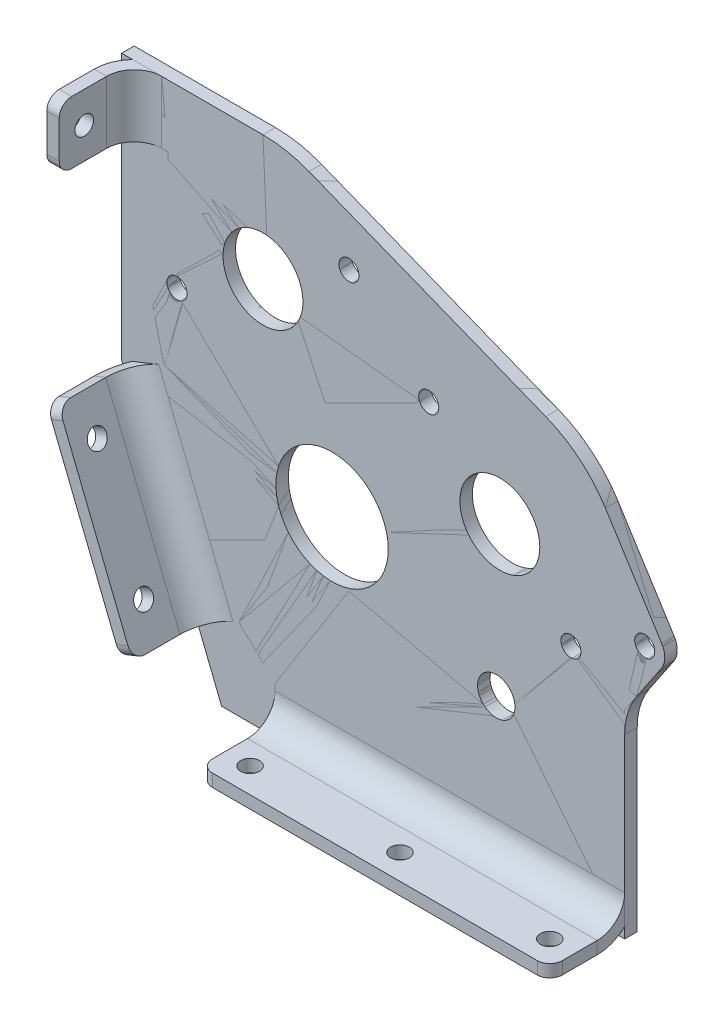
ISO-10303-21;
HEADER;
FILE_DESCRIPTION(('STEP AP214'),'2;1');
FILE_NAME('part.step','',(''),(''),'','','');
FILE_SCHEMA(('AUTOMOTIVE_DESIGN { 1 0 10303 214 1 1 1 1 }'));
ENDSEC;
DATA;
#1=APPLICATION_CONTEXT('core data for automotive mechanical design processes');
#2=APPLICATION_PROTOCOL_DEFINITION('international standard','automotive_design',2000,#1);
#3=PRODUCT_CONTEXT('',#1,'mechanical');
#4=PRODUCT('Part','Part','',(#3));
#5=PRODUCT_RELATED_PRODUCT_CATEGORY('part','',(#4));
#6=PRODUCT_DEFINITION_FORMATION('','',#4);
#7=PRODUCT_DEFINITION_CONTEXT('part definition',#1,'design');
#8=PRODUCT_DEFINITION('design','',#6,#7);
#9=PRODUCT_DEFINITION_SHAPE('','',#8);
#10=(LENGTH_UNIT() NAMED_UNIT(*) SI_UNIT(.MILLI.,.METRE.));
#11=(NAMED_UNIT(*) PLANE_ANGLE_UNIT() SI_UNIT($,.RADIAN.));
#12=(NAMED_UNIT(*) SI_UNIT($,.STERADIAN.) SOLID_ANGLE_UNIT());
#13=UNCERTAINTY_MEASURE_WITH_UNIT(LENGTH_MEASURE(1.E-05),#10,'distance_accuracy_value','');
#14=(GEOMETRIC_REPRESENTATION_CONTEXT(3) GLOBAL_UNCERTAINTY_ASSIGNED_CONTEXT((#13)) GLOBAL_UNIT_ASSIGNED_CONTEXT((#10,
#11,#12)) REPRESENTATION_CONTEXT('',''));
#15=CARTESIAN_POINT('',(0.,0.,0.));
#16=DIRECTION('',(0.,0.,1.));
#17=DIRECTION('',(1.,0.,0.));
#18=AXIS2_PLACEMENT_3D('',#15,#16,#17);
#19=CARTESIAN_POINT('',(17.6874809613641,58.3464975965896,15.875));
#20=DIRECTION('',(-0.928476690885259,-0.371390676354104,0.));
#21=DIRECTION('',(0.371390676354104,-0.928476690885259,0.));
#22=AXIS2_PLACEMENT_3D('',#19,#20,#21);
#23=CYLINDRICAL_SURFACE('',#22,3.175);
#24=DIRECTION('',(-0.928476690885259,-0.371390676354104,0.));
#25=VECTOR('',#24,1.);
#26=CARTESIAN_POINT('',(18.8666463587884,55.3985841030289,15.875));
#27=LINE('',#26,#25);
#28=CARTESIAN_POINT('',(21.8145598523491,56.5777495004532,15.875));
#29=VERTEX_POINT('',#28);
#30=CARTESIAN_POINT('',(18.8666463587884,55.3985841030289,15.875));
#31=VERTEX_POINT('',#30);
#32=EDGE_CURVE('E12',#29,#31,#27,.T.);
#33=ORIENTED_EDGE('',*,*,#32,.F.);
#34=CARTESIAN_POINT('',(20.6353944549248,59.5256629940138,15.875));
#35=DIRECTION('',(-0.928476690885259,-0.371390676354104,0.));
#36=DIRECTION('',(0.371390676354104,-0.928476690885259,0.));
#37=AXIS2_PLACEMENT_3D('',#34,#35,#36);
#38=CIRCLE('',#37,3.175);
#39=CARTESIAN_POINT('',(20.6353944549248,59.5256629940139,19.05));
#40=VERTEX_POINT('',#39);
#41=EDGE_CURVE('E234',#40,#29,#38,.F.);
#42=ORIENTED_EDGE('',*,*,#41,.F.);
#43=DIRECTION('',(-0.928476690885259,-0.371390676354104,0.));
#44=VECTOR('',#43,1.);
#45=CARTESIAN_POINT('',(17.6874809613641,58.3464975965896,19.05));
#46=LINE('',#45,#44);
#47=CARTESIAN_POINT('',(17.6874809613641,58.3464975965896,19.05));
#48=VERTEX_POINT('',#47);
#49=EDGE_CURVE('E63',#40,#48,#46,.T.);
#50=ORIENTED_EDGE('',*,*,#49,.T.);
#51=CARTESIAN_POINT('',(17.6874809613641,58.3464975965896,15.875));
#52=DIRECTION('',(-0.928476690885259,-0.371390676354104,0.));
#53=DIRECTION('',(-0.371390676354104,0.928476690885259,0.));
#54=AXIS2_PLACEMENT_3D('',#51,#52,#53);
#55=CIRCLE('',#54,3.175);
#56=EDGE_CURVE('E541',#48,#31,#55,.F.);
#57=ORIENTED_EDGE('',*,*,#56,.T.);
#58=EDGE_LOOP('',(#33,#42,#50,#57));
#59=FACE_BOUND('',#58,.T.);
#60=ADVANCED_FACE('F53',(#59),#23,.T.);
#61=CARTESIAN_POINT('',(35.3673103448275,14.146924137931,19.05));
#62=DIRECTION('',(0.,0.,1.));
#63=DIRECTION('',(0.371390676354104,-0.928476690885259,0.));
#64=AXIS2_PLACEMENT_3D('',#61,#62,#63);
#65=PLANE('',#64);
#66=ORIENTED_EDGE('',*,*,#49,.F.);
#67=DIRECTION('',(-0.371390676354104,0.928476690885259,0.));
#68=VECTOR('',#67,1.);
#69=CARTESIAN_POINT('',(38.3152238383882,15.3260895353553,19.05));
#70=LINE('',#69,#68);
#71=CARTESIAN_POINT('',(4.1270788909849,100.796451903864,19.05));
#72=VERTEX_POINT('',#71);
#73=EDGE_CURVE('E365',#72,#40,#70,.F.);
#74=ORIENTED_EDGE('',*,*,#73,.F.);
#75=DIRECTION('',(-0.928476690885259,-0.371390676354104,0.));
#76=VECTOR('',#75,1.);
#77=CARTESIAN_POINT('',(1.17916539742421,99.6172865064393,19.05));
#78=LINE('',#77,#76);
#79=CARTESIAN_POINT('',(1.17916539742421,99.6172865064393,19.05));
#80=VERTEX_POINT('',#79);
#81=EDGE_CURVE('E519',#72,#80,#78,.T.);
#82=ORIENTED_EDGE('',*,*,#81,.T.);
#83=DIRECTION('',(0.371390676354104,-0.928476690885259,0.));
#84=VECTOR('',#83,1.);
#85=CARTESIAN_POINT('',(35.3673103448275,14.146924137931,19.05));
#86=LINE('',#85,#84);
#87=EDGE_CURVE('E528',#80,#48,#86,.T.);
#88=ORIENTED_EDGE('',*,*,#87,.T.);
#89=EDGE_LOOP('',(#66,#74,#82,#88));
#90=FACE_BOUND('',#89,.T.);
#91=ADVANCED_FACE('F527',(#90),#65,.T.);
#92=CARTESIAN_POINT('',(1.17916539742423,99.6172865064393,15.875));
#93=DIRECTION('',(-0.928476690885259,-0.371390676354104,0.));
#94=DIRECTION('',(0.371390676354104,-0.928476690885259,0.));
#95=AXIS2_PLACEMENT_3D('',#92,#93,#94);
#96=CYLINDRICAL_SURFACE('',#95,3.175);
#97=ORIENTED_EDGE('',*,*,#81,.F.);
#98=CARTESIAN_POINT('',(4.12707889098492,100.796451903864,15.875));
#99=DIRECTION('',(-0.928476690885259,-0.371390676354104,0.));
#100=DIRECTION('',(0.371390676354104,-0.928476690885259,0.));
#101=AXIS2_PLACEMENT_3D('',#98,#99,#100);
#102=CIRCLE('',#101,3.175);
#103=CARTESIAN_POINT('',(2.94791349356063,103.744365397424,15.875));
#104=VERTEX_POINT('',#103);
#105=EDGE_CURVE('E362',#104,#72,#102,.F.);
#106=ORIENTED_EDGE('',*,*,#105,.F.);
#107=DIRECTION('',(-0.928476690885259,-0.371390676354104,0.));
#108=VECTOR('',#107,1.);
#109=CARTESIAN_POINT('',(0.,102.5652,15.875));
#110=LINE('',#109,#108);
#111=CARTESIAN_POINT('',(0.,102.5652,15.875));
#112=VERTEX_POINT('',#111);
#113=EDGE_CURVE('E516',#104,#112,#110,.T.);
#114=ORIENTED_EDGE('',*,*,#113,.T.);
#115=CARTESIAN_POINT('',(1.17916539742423,99.6172865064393,15.875));
#116=DIRECTION('',(-0.928476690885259,-0.371390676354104,0.));
#117=DIRECTION('',(-0.371390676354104,0.928476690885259,0.));
#118=AXIS2_PLACEMENT_3D('',#115,#116,#117);
#119=CIRCLE('',#118,3.175);
#120=EDGE_CURVE('E539',#112,#80,#119,.F.);
#121=ORIENTED_EDGE('',*,*,#120,.T.);
#122=EDGE_LOOP('',(#97,#106,#114,#121));
#123=FACE_BOUND('',#122,.T.);
#124=ADVANCED_FACE('F544',(#123),#96,.T.);
#125=CARTESIAN_POINT('',(0.,102.5652,1.38350565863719E-13));
#126=DIRECTION('',(-0.371390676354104,0.928476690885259,0.));
#127=DIRECTION('',(0.,0.,1.));
#128=AXIS2_PLACEMENT_3D('',#125,#126,#127);
#129=PLANE('',#128);
#130=ORIENTED_EDGE('',*,*,#113,.F.);
#131=DIRECTION('',(0.,0.,1.));
#132=VECTOR('',#131,1.);
#133=CARTESIAN_POINT('',(2.94791349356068,103.744365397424,1.36850079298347E-13));
#134=LINE('',#133,#132);
#135=CARTESIAN_POINT('',(2.94791349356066,103.744365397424,6.99999999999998));
#136=VERTEX_POINT('',#135);
#137=EDGE_CURVE('E230',#136,#104,#134,.T.);
#138=ORIENTED_EDGE('',*,*,#137,.F.);
#139=DIRECTION('',(-0.928476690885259,-0.371390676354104,0.));
#140=VECTOR('',#139,1.);
#141=CARTESIAN_POINT('',(0.,102.5652,6.99999999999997));
#142=LINE('',#141,#140);
#143=CARTESIAN_POINT('',(0.,102.5652,6.99999999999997));
#144=VERTEX_POINT('',#143);
#145=EDGE_CURVE('E513',#136,#144,#142,.T.);
#146=ORIENTED_EDGE('',*,*,#145,.T.);
#147=DIRECTION('',(0.,0.,1.));
#148=VECTOR('',#147,1.);
#149=CARTESIAN_POINT('',(0.,102.5652,1.38350565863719E-13));
#150=LINE('',#149,#148);
#151=EDGE_CURVE('E545',#144,#112,#150,.T.);
#152=ORIENTED_EDGE('',*,*,#151,.T.);
#153=EDGE_LOOP('',(#130,#138,#146,#152));
#154=FACE_BOUND('',#153,.T.);
#155=ADVANCED_FACE('F879',(#154),#129,.T.);
#156=CARTESIAN_POINT('',(9.44725032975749,106.344100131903,7.));
#157=DIRECTION('',(-0.371390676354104,0.92847669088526,0.));
#158=DIRECTION('',(-0.928476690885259,-0.371390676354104,0.));
#159=AXIS2_PLACEMENT_3D('',#156,#157,#158);
#160=PLANE('',#159);
#161=ORIENTED_EDGE('',*,*,#145,.F.);
#162=CARTESIAN_POINT('',(9.44725032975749,106.344100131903,7.));
#163=DIRECTION('',(-0.371390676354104,0.92847669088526,0.));
#164=DIRECTION('',(-0.928476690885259,-0.371390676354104,0.));
#165=AXIS2_PLACEMENT_3D('',#162,#163,#164);
#166=CIRCLE('',#165,7.);
#167=CARTESIAN_POINT('',(9.44725032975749,106.344100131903,0.));
#168=VERTEX_POINT('',#167);
#169=EDGE_CURVE('E226',#136,#168,#166,.F.);
#170=ORIENTED_EDGE('',*,*,#169,.T.);
#171=DIRECTION('',(0.,0.,-1.));
#172=VECTOR('',#171,1.);
#173=CARTESIAN_POINT('',(9.44725032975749,106.344100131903,-3.17499999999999));
#174=LINE('',#173,#172);
#175=CARTESIAN_POINT('',(9.44725032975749,106.344100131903,-3.17499999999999));
#176=VERTEX_POINT('',#175);
#177=EDGE_CURVE('E510',#168,#176,#174,.T.);
#178=ORIENTED_EDGE('',*,*,#177,.T.);
#179=CARTESIAN_POINT('',(9.44725032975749,106.344100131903,7.));
#180=DIRECTION('',(0.371390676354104,-0.92847669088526,0.));
#181=DIRECTION('',(-0.928476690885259,-0.371390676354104,0.));
#182=AXIS2_PLACEMENT_3D('',#179,#180,#181);
#183=CIRCLE('',#182,10.175);
#184=EDGE_CURVE('E215',#144,#176,#183,.T.);
#185=ORIENTED_EDGE('',*,*,#184,.F.);
#186=EDGE_LOOP('',(#161,#170,#178,#185));
#187=FACE_BOUND('',#186,.T.);
#188=ADVANCED_FACE('F875',(#187),#160,.T.);
#189=CARTESIAN_POINT('',(-35.3673103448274,88.4182758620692,-3.175));
#190=DIRECTION('',(0.371390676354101,-0.928476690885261,0.));
#191=DIRECTION('',(-0.92847669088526,-0.371390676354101,0.));
#192=AXIS2_PLACEMENT_3D('',#189,#190,#191);
#193=PLANE('',#192);
#194=ORIENTED_EDGE('',*,*,#177,.F.);
#195=DIRECTION('',(-0.92847669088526,-0.371390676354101,0.));
#196=VECTOR('',#195,1.);
#197=CARTESIAN_POINT('',(-35.3673103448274,88.4182758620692,0.));
#198=LINE('',#197,#196);
#199=CARTESIAN_POINT('',(10.9212070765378,106.933682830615,0.));
#200=VERTEX_POINT('',#199);
#201=EDGE_CURVE('E358',#200,#168,#198,.T.);
#202=ORIENTED_EDGE('',*,*,#201,.F.);
#203=DIRECTION('',(0.,0.,-1.));
#204=VECTOR('',#203,1.);
#205=CARTESIAN_POINT('',(10.9212070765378,106.933682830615,-3.175));
#206=LINE('',#205,#204);
#207=CARTESIAN_POINT('',(10.9212070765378,106.933682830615,-3.175));
#208=VERTEX_POINT('',#207);
#209=EDGE_CURVE('E507',#200,#208,#206,.T.);
#210=ORIENTED_EDGE('',*,*,#209,.T.);
#211=DIRECTION('',(-0.92847669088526,-0.371390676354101,0.));
#212=VECTOR('',#211,1.);
#213=CARTESIAN_POINT('',(-35.3673103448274,88.4182758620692,-3.175));
#214=LINE('',#213,#212);
#215=EDGE_CURVE('E1743',#208,#176,#214,.T.);
#216=ORIENTED_EDGE('',*,*,#215,.T.);
#217=EDGE_LOOP('',(#194,#202,#210,#216));
#218=FACE_BOUND('',#217,.T.);
#219=ADVANCED_FACE('F871',(#218),#193,.F.);
#220=CARTESIAN_POINT('',(46.2885174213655,18.5154069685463,-3.175));
#221=DIRECTION('',(0.928476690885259,0.371390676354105,0.));
#222=DIRECTION('',(0.371390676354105,-0.928476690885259,0.));
#223=AXIS2_PLACEMENT_3D('',#220,#221,#222);
#224=PLANE('',#223);
#225=ORIENTED_EDGE('',*,*,#209,.F.);
#226=DIRECTION('',(0.371390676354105,-0.928476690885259,0.));
#227=VECTOR('',#226,1.);
#228=CARTESIAN_POINT('',(46.2885174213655,18.5154069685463,0.));
#229=LINE('',#228,#227);
#230=CARTESIAN_POINT('',(10.5101280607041,107.9613803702,0.));
#231=VERTEX_POINT('',#230);
#232=EDGE_CURVE('E355',#231,#200,#229,.T.);
#233=ORIENTED_EDGE('',*,*,#232,.F.);
#234=DIRECTION('',(0.,0.,-1.));
#235=VECTOR('',#234,1.);
#236=CARTESIAN_POINT('',(10.5101280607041,107.9613803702,-3.175));
#237=LINE('',#236,#235);
#238=CARTESIAN_POINT('',(10.5101280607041,107.9613803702,-3.175));
#239=VERTEX_POINT('',#238);
#240=EDGE_CURVE('E504',#231,#239,#237,.T.);
#241=ORIENTED_EDGE('',*,*,#240,.T.);
#242=DIRECTION('',(0.371390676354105,-0.928476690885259,0.));
#243=VECTOR('',#242,1.);
#244=CARTESIAN_POINT('',(46.2885174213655,18.5154069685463,-3.175));
#245=LINE('',#244,#243);
#246=EDGE_CURVE('E1745',#239,#208,#245,.T.);
#247=ORIENTED_EDGE('',*,*,#246,.T.);
#248=EDGE_LOOP('',(#225,#233,#241,#247));
#249=FACE_BOUND('',#248,.T.);
#250=ADVANCED_FACE('F867',(#249),#224,.F.);
#251=CARTESIAN_POINT('',(16.4059550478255,110.319711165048,-3.175));
#252=DIRECTION('',(0.,0.,1.));
#253=DIRECTION('',(1.,0.,0.));
#254=AXIS2_PLACEMENT_3D('',#251,#252,#253);
#255=CYLINDRICAL_SURFACE('',#254,6.35);
#256=ORIENTED_EDGE('',*,*,#240,.F.);
#257=CARTESIAN_POINT('',(16.4059550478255,110.319711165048,0.));
#258=DIRECTION('',(0.,0.,1.));
#259=DIRECTION('',(1.,0.,0.));
#260=AXIS2_PLACEMENT_3D('',#257,#258,#259);
#261=CIRCLE('',#260,6.35);
#262=CARTESIAN_POINT('',(10.2223248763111,108.87568280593,0.));
#263=VERTEX_POINT('',#262);
#264=EDGE_CURVE('E351',#263,#231,#261,.T.);
#265=ORIENTED_EDGE('',*,*,#264,.F.);
#266=DIRECTION('',(0.,0.,-1.));
#267=VECTOR('',#266,1.);
#268=CARTESIAN_POINT('',(10.2223248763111,108.87568280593,-3.175));
#269=LINE('',#268,#267);
#270=CARTESIAN_POINT('',(10.2223248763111,108.87568280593,-3.175));
#271=VERTEX_POINT('',#270);
#272=EDGE_CURVE('E501',#263,#271,#269,.T.);
#273=ORIENTED_EDGE('',*,*,#272,.T.);
#274=CARTESIAN_POINT('',(16.4059550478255,110.319711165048,-3.175));
#275=DIRECTION('',(0.,0.,1.));
#276=DIRECTION('',(1.,0.,0.));
#277=AXIS2_PLACEMENT_3D('',#274,#275,#276);
#278=CIRCLE('',#277,6.35);
#279=EDGE_CURVE('E1748',#271,#239,#278,.T.);
#280=ORIENTED_EDGE('',*,*,#279,.T.);
#281=EDGE_LOOP('',(#256,#265,#273,#280));
#282=FACE_BOUND('',#281,.T.);
#283=ADVANCED_FACE('F863',(#282),#255,.T.);
#284=CARTESIAN_POINT('',(33.8039957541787,7.89405691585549,-3.175));
#285=DIRECTION('',(-0.973800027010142,-0.227406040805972,0.));
#286=DIRECTION('',(-0.227406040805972,0.973800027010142,0.));
#287=AXIS2_PLACEMENT_3D('',#284,#285,#286);
#288=PLANE('',#287);
#289=ORIENTED_EDGE('',*,*,#272,.F.);
#290=DIRECTION('',(-0.227406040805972,0.973800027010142,0.));
#291=VECTOR('',#290,1.);
#292=CARTESIAN_POINT('',(33.8039957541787,7.89405691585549,0.));
#293=LINE('',#292,#291);
#294=CARTESIAN_POINT('',(5.01222367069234,131.186421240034,0.));
#295=VERTEX_POINT('',#294);
#296=EDGE_CURVE('E348',#263,#295,#293,.T.);
#297=ORIENTED_EDGE('',*,*,#296,.T.);
#298=DIRECTION('',(0.,0.,-1.));
#299=VECTOR('',#298,1.);
#300=CARTESIAN_POINT('',(5.01222367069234,131.186421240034,-3.175));
#301=LINE('',#300,#299);
#302=CARTESIAN_POINT('',(5.01222367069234,131.186421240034,-3.175));
#303=VERTEX_POINT('',#302);
#304=EDGE_CURVE('E498',#295,#303,#301,.T.);
#305=ORIENTED_EDGE('',*,*,#304,.T.);
#306=DIRECTION('',(-0.227406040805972,0.973800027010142,0.));
#307=VECTOR('',#306,1.);
#308=CARTESIAN_POINT('',(33.8039957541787,7.89405691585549,-3.175));
#309=LINE('',#308,#307);
#310=EDGE_CURVE('E240',#271,#303,#309,.T.);
#311=ORIENTED_EDGE('',*,*,#310,.F.);
#312=EDGE_LOOP('',(#289,#297,#305,#311));
#313=FACE_BOUND('',#312,.T.);
#314=ADVANCED_FACE('F859',(#313),#288,.T.);
#315=CARTESIAN_POINT('',(35.9303745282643,138.406563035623,-3.175));
#316=DIRECTION('',(0.,0.,1.));
#317=DIRECTION('',(1.,0.,0.));
#318=AXIS2_PLACEMENT_3D('',#315,#316,#317);
#319=CYLINDRICAL_SURFACE('',#318,31.75);
#320=ORIENTED_EDGE('',*,*,#304,.F.);
#321=CARTESIAN_POINT('',(35.9303745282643,138.406563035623,0.));
#322=DIRECTION('',(0.,0.,1.));
#323=DIRECTION('',(1.,0.,0.));
#324=AXIS2_PLACEMENT_3D('',#321,#322,#323);
#325=CIRCLE('',#324,31.75);
#326=CARTESIAN_POINT('',(5.22526056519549,146.48483491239,0.));
#327=VERTEX_POINT('',#326);
#328=EDGE_CURVE('E345',#327,#295,#325,.T.);
#329=ORIENTED_EDGE('',*,*,#328,.F.);
#330=DIRECTION('',(0.,0.,-1.));
#331=VECTOR('',#330,1.);
#332=CARTESIAN_POINT('',(5.22526056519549,146.48483491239,-3.175));
#333=LINE('',#332,#331);
#334=CARTESIAN_POINT('',(5.22526056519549,146.48483491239,-3.175));
#335=VERTEX_POINT('',#334);
#336=EDGE_CURVE('E495',#327,#335,#333,.T.);
#337=ORIENTED_EDGE('',*,*,#336,.T.);
#338=CARTESIAN_POINT('',(35.9303745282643,138.406563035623,-3.175));
#339=DIRECTION('',(0.,0.,1.));
#340=DIRECTION('',(1.,0.,0.));
#341=AXIS2_PLACEMENT_3D('',#338,#339,#340);
#342=CIRCLE('',#341,31.75);
#343=EDGE_CURVE('E1701',#335,#303,#342,.T.);
#344=ORIENTED_EDGE('',*,*,#343,.T.);
#345=EDGE_LOOP('',(#320,#329,#337,#344));
#346=FACE_BOUND('',#345,.T.);
#347=ADVANCED_FACE('F855',(#346),#319,.T.);
#348=CARTESIAN_POINT('',(11.3662833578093,144.869180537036,-3.175));
#349=DIRECTION('',(0.,0.,1.));
#350=DIRECTION('',(1.,0.,0.));
#351=AXIS2_PLACEMENT_3D('',#348,#349,#350);
#352=CYLINDRICAL_SURFACE('',#351,6.35);
#353=ORIENTED_EDGE('',*,*,#336,.F.);
#354=CARTESIAN_POINT('',(11.3662833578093,144.869180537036,0.));
#355=DIRECTION('',(0.,0.,1.));
#356=DIRECTION('',(1.,0.,0.));
#357=AXIS2_PLACEMENT_3D('',#354,#355,#356);
#358=CIRCLE('',#357,6.35);
#359=CARTESIAN_POINT('',(7.91164957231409,150.197220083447,0.));
#360=VERTEX_POINT('',#359);
#361=EDGE_CURVE('E342',#360,#327,#358,.T.);
#362=ORIENTED_EDGE('',*,*,#361,.F.);
#363=DIRECTION('',(0.,0.,-1.));
#364=VECTOR('',#363,1.);
#365=CARTESIAN_POINT('',(7.91164957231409,150.197220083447,-3.175));
#366=LINE('',#365,#364);
#367=CARTESIAN_POINT('',(7.91164957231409,150.197220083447,-3.175));
#368=VERTEX_POINT('',#367);
#369=EDGE_CURVE('E492',#360,#368,#366,.T.);
#370=ORIENTED_EDGE('',*,*,#369,.T.);
#371=CARTESIAN_POINT('',(11.3662833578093,144.869180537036,-3.175));
#372=DIRECTION('',(0.,0.,1.));
#373=DIRECTION('',(1.,0.,0.));
#374=AXIS2_PLACEMENT_3D('',#371,#372,#373);
#375=CIRCLE('',#374,6.35);
#376=EDGE_CURVE('E1697',#368,#335,#375,.T.);
#377=ORIENTED_EDGE('',*,*,#376,.T.);
#378=EDGE_LOOP('',(#353,#362,#370,#377));
#379=FACE_BOUND('',#378,.T.);
#380=ADVANCED_FACE('F851',(#379),#352,.T.);
#381=CARTESIAN_POINT('',(-66.22040775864,102.130927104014,-3.175));
#382=DIRECTION('',(0.544036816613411,-0.839061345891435,0.));
#383=DIRECTION('',(-0.839061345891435,-0.544036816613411,0.));
#384=AXIS2_PLACEMENT_3D('',#381,#382,#383);
#385=PLANE('',#384);
#386=ORIENTED_EDGE('',*,*,#369,.F.);
#387=DIRECTION('',(-0.839061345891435,-0.544036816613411,0.));
#388=VECTOR('',#387,1.);
#389=CARTESIAN_POINT('',(-66.22040775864,102.130927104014,0.));
#390=LINE('',#389,#388);
#391=CARTESIAN_POINT('',(11.7625,152.694063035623,0.));
#392=VERTEX_POINT('',#391);
#393=EDGE_CURVE('E339',#392,#360,#390,.T.);
#394=ORIENTED_EDGE('',*,*,#393,.F.);
#395=DIRECTION('',(0.,0.,-1.));
#396=VECTOR('',#395,1.);
#397=CARTESIAN_POINT('',(11.7625,152.694063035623,-3.175));
#398=LINE('',#397,#396);
#399=CARTESIAN_POINT('',(11.7625,152.694063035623,-3.175));
#400=VERTEX_POINT('',#399);
#401=EDGE_CURVE('E489',#392,#400,#398,.T.);
#402=ORIENTED_EDGE('',*,*,#401,.T.);
#403=DIRECTION('',(-0.839061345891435,-0.544036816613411,0.));
#404=VECTOR('',#403,1.);
#405=CARTESIAN_POINT('',(-66.22040775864,102.130927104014,-3.175));
#406=LINE('',#405,#404);
#407=EDGE_CURVE('E1693',#400,#368,#406,.T.);
#408=ORIENTED_EDGE('',*,*,#407,.T.);
#409=EDGE_LOOP('',(#386,#394,#402,#408));
#410=FACE_BOUND('',#409,.T.);
#411=ADVANCED_FACE('F847',(#410),#385,.F.);
#412=CARTESIAN_POINT('',(11.7625,0.,-3.175));
#413=DIRECTION('',(1.,0.,0.));
#414=DIRECTION('',(0.,-1.,0.));
#415=AXIS2_PLACEMENT_3D('',#412,#413,#414);
#416=PLANE('',#415);
#417=ORIENTED_EDGE('',*,*,#401,.F.);
#418=DIRECTION('',(0.,-1.,0.));
#419=VECTOR('',#418,1.);
#420=CARTESIAN_POINT('',(11.7625,0.,0.));
#421=LINE('',#420,#419);
#422=CARTESIAN_POINT('',(11.7625,154.281563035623,0.));
#423=VERTEX_POINT('',#422);
#424=EDGE_CURVE('E336',#423,#392,#421,.T.);
#425=ORIENTED_EDGE('',*,*,#424,.F.);
#426=DIRECTION('',(0.,0.,-1.));
#427=VECTOR('',#426,1.);
#428=CARTESIAN_POINT('',(11.7625,154.281563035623,-3.175));
#429=LINE('',#428,#427);
#430=CARTESIAN_POINT('',(11.7625,154.281563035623,-3.175));
#431=VERTEX_POINT('',#430);
#432=EDGE_CURVE('E486',#423,#431,#429,.T.);
#433=ORIENTED_EDGE('',*,*,#432,.T.);
#434=DIRECTION('',(0.,-1.,0.));
#435=VECTOR('',#434,1.);
#436=CARTESIAN_POINT('',(11.7625,0.,-3.175));
#437=LINE('',#436,#435);
#438=EDGE_CURVE('E1689',#431,#400,#437,.T.);
#439=ORIENTED_EDGE('',*,*,#438,.T.);
#440=EDGE_LOOP('',(#417,#425,#433,#439));
#441=FACE_BOUND('',#440,.T.);
#442=ADVANCED_FACE('F843',(#441),#416,.F.);
#443=CARTESIAN_POINT('',(0.,154.281563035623,-3.175));
#444=DIRECTION('',(0.,1.,0.));
#445=DIRECTION('',(1.,0.,0.));
#446=AXIS2_PLACEMENT_3D('',#443,#444,#445);
#447=PLANE('',#446);
#448=ORIENTED_EDGE('',*,*,#432,.F.);
#449=DIRECTION('',(1.,0.,0.));
#450=VECTOR('',#449,1.);
#451=CARTESIAN_POINT('',(0.,154.281563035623,0.));
#452=LINE('',#451,#450);
#453=CARTESIAN_POINT('',(10.175,154.281563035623,0.));
#454=VERTEX_POINT('',#453);
#455=EDGE_CURVE('E333',#454,#423,#452,.T.);
#456=ORIENTED_EDGE('',*,*,#455,.F.);
#457=DIRECTION('',(0.,0.,-1.));
#458=VECTOR('',#457,1.);
#459=CARTESIAN_POINT('',(10.175,154.281563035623,-3.175));
#460=LINE('',#459,#458);
#461=CARTESIAN_POINT('',(10.175,154.281563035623,-3.175));
#462=VERTEX_POINT('',#461);
#463=EDGE_CURVE('E483',#454,#462,#460,.T.);
#464=ORIENTED_EDGE('',*,*,#463,.T.);
#465=DIRECTION('',(1.,0.,0.));
#466=VECTOR('',#465,1.);
#467=CARTESIAN_POINT('',(0.,154.281563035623,-3.175));
#468=LINE('',#467,#466);
#469=EDGE_CURVE('E1699',#462,#431,#468,.T.);
#470=ORIENTED_EDGE('',*,*,#469,.T.);
#471=EDGE_LOOP('',(#448,#456,#464,#470));
#472=FACE_BOUND('',#471,.T.);
#473=ADVANCED_FACE('F839',(#472),#447,.F.);
#474=CARTESIAN_POINT('',(10.175,154.281563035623,6.99999999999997));
#475=DIRECTION('',(0.,1.,0.));
#476=DIRECTION('',(0.,0.,1.));
#477=AXIS2_PLACEMENT_3D('',#474,#475,#476);
#478=PLANE('',#477);
#479=ORIENTED_EDGE('',*,*,#463,.F.);
#480=CARTESIAN_POINT('',(10.175,154.281563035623,6.99999999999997));
#481=DIRECTION('',(0.,1.,0.));
#482=DIRECTION('',(0.,0.,1.));
#483=AXIS2_PLACEMENT_3D('',#480,#481,#482);
#484=CIRCLE('',#483,7.);
#485=CARTESIAN_POINT('',(3.17499999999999,154.281563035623,6.99999999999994));
#486=VERTEX_POINT('',#485);
#487=EDGE_CURVE('E314',#454,#486,#484,.T.);
#488=ORIENTED_EDGE('',*,*,#487,.T.);
#489=DIRECTION('',(-1.,0.,0.));
#490=VECTOR('',#489,1.);
#491=CARTESIAN_POINT('',(0.,154.281563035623,6.99999999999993));
#492=LINE('',#491,#490);
#493=CARTESIAN_POINT('',(0.,154.281563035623,6.99999999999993));
#494=VERTEX_POINT('',#493);
#495=EDGE_CURVE('E480',#486,#494,#492,.T.);
#496=ORIENTED_EDGE('',*,*,#495,.T.);
#497=CARTESIAN_POINT('',(10.175,154.281563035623,6.99999999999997));
#498=DIRECTION('',(0.,-1.,0.));
#499=DIRECTION('',(0.,0.,-1.));
#500=AXIS2_PLACEMENT_3D('',#497,#498,#499);
#501=CIRCLE('',#500,10.175);
#502=EDGE_CURVE('E1594',#462,#494,#501,.F.);
#503=ORIENTED_EDGE('',*,*,#502,.F.);
#504=EDGE_LOOP('',(#479,#488,#496,#503));
#505=FACE_BOUND('',#504,.T.);
#506=ADVANCED_FACE('F835',(#505),#478,.F.);
#507=CARTESIAN_POINT('',(0.,154.281563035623,0.));
#508=DIRECTION('',(0.,-1.,0.));
#509=DIRECTION('',(0.,0.,-1.));
#510=AXIS2_PLACEMENT_3D('',#507,#508,#509);
#511=PLANE('',#510);
#512=ORIENTED_EDGE('',*,*,#495,.F.);
#513=DIRECTION('',(0.,0.,1.));
#514=VECTOR('',#513,1.);
#515=CARTESIAN_POINT('',(3.17500000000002,154.281563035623,0.));
#516=LINE('',#515,#514);
#517=CARTESIAN_POINT('',(3.17499999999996,154.281563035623,15.875));
#518=VERTEX_POINT('',#517);
#519=EDGE_CURVE('E328',#518,#486,#516,.F.);
#520=ORIENTED_EDGE('',*,*,#519,.F.);
#521=DIRECTION('',(-1.,0.,0.));
#522=VECTOR('',#521,1.);
#523=CARTESIAN_POINT('',(0.,154.281563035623,15.875));
#524=LINE('',#523,#522);
#525=CARTESIAN_POINT('',(0.,154.281563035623,15.875));
#526=VERTEX_POINT('',#525);
#527=EDGE_CURVE('E477',#518,#526,#524,.T.);
#528=ORIENTED_EDGE('',*,*,#527,.T.);
#529=DIRECTION('',(0.,0.,-1.));
#530=VECTOR('',#529,1.);
#531=CARTESIAN_POINT('',(0.,154.281563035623,0.));
#532=LINE('',#531,#530);
#533=EDGE_CURVE('E1588',#526,#494,#532,.T.);
#534=ORIENTED_EDGE('',*,*,#533,.T.);
#535=EDGE_LOOP('',(#512,#520,#528,#534));
#536=FACE_BOUND('',#535,.T.);
#537=ADVANCED_FACE('F831',(#536),#511,.T.);
#538=CARTESIAN_POINT('',(0.,157.456563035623,15.875));
#539=DIRECTION('',(-1.,0.,0.));
#540=DIRECTION('',(0.,0.,1.));
#541=AXIS2_PLACEMENT_3D('',#538,#539,#540);
#542=CYLINDRICAL_SURFACE('',#541,3.175);
#543=ORIENTED_EDGE('',*,*,#527,.F.);
#544=CARTESIAN_POINT('',(3.17499999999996,157.456563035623,15.875));
#545=DIRECTION('',(-1.,0.,0.));
#546=DIRECTION('',(0.,0.,1.));
#547=AXIS2_PLACEMENT_3D('',#544,#545,#546);
#548=CIRCLE('',#547,3.175);
#549=CARTESIAN_POINT('',(3.17499999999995,157.456563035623,19.05));
#550=VERTEX_POINT('',#549);
#551=EDGE_CURVE('E325',#550,#518,#548,.F.);
#552=ORIENTED_EDGE('',*,*,#551,.F.);
#553=DIRECTION('',(-1.,0.,0.));
#554=VECTOR('',#553,1.);
#555=CARTESIAN_POINT('',(0.,157.456563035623,19.05));
#556=LINE('',#555,#554);
#557=CARTESIAN_POINT('',(0.,157.456563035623,19.05));
#558=VERTEX_POINT('',#557);
#559=EDGE_CURVE('E474',#550,#558,#556,.T.);
#560=ORIENTED_EDGE('',*,*,#559,.T.);
#561=CARTESIAN_POINT('',(0.,157.456563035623,15.875));
#562=DIRECTION('',(-1.,0.,0.));
#563=DIRECTION('',(0.,0.,1.));
#564=AXIS2_PLACEMENT_3D('',#561,#562,#563);
#565=CIRCLE('',#564,3.175);
#566=EDGE_CURVE('E1591',#558,#526,#565,.F.);
#567=ORIENTED_EDGE('',*,*,#566,.T.);
#568=EDGE_LOOP('',(#543,#552,#560,#567));
#569=FACE_BOUND('',#568,.T.);
#570=ADVANCED_FACE('F827',(#569),#542,.T.);
#571=CARTESIAN_POINT('',(0.,0.,19.05));
#572=DIRECTION('',(0.,0.,1.));
#573=DIRECTION('',(0.,-1.,0.));
#574=AXIS2_PLACEMENT_3D('',#571,#572,#573);
#575=PLANE('',#574);
#576=ORIENTED_EDGE('',*,*,#559,.F.);
#577=DIRECTION('',(0.,-1.,0.));
#578=VECTOR('',#577,1.);
#579=CARTESIAN_POINT('',(3.17499999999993,0.,19.05));
#580=LINE('',#579,#578);
#581=CARTESIAN_POINT('',(3.17499999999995,166.981563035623,19.05));
#582=VERTEX_POINT('',#581);
#583=EDGE_CURVE('E321',#582,#550,#580,.T.);
#584=ORIENTED_EDGE('',*,*,#583,.F.);
#585=DIRECTION('',(-1.,0.,0.));
#586=VECTOR('',#585,1.);
#587=CARTESIAN_POINT('',(0.,166.981563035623,19.05));
#588=LINE('',#587,#586);
#589=CARTESIAN_POINT('',(0.,166.981563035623,19.05));
#590=VERTEX_POINT('',#589);
#591=EDGE_CURVE('E471',#582,#590,#588,.T.);
#592=ORIENTED_EDGE('',*,*,#591,.T.);
#593=DIRECTION('',(0.,-1.,0.));
#594=VECTOR('',#593,1.);
#595=CARTESIAN_POINT('',(0.,0.,19.05));
#596=LINE('',#595,#594);
#597=EDGE_CURVE('E1572',#590,#558,#596,.T.);
#598=ORIENTED_EDGE('',*,*,#597,.T.);
#599=EDGE_LOOP('',(#576,#584,#592,#598));
#600=FACE_BOUND('',#599,.T.);
#601=ADVANCED_FACE('F823',(#600),#575,.T.);
#602=CARTESIAN_POINT('',(0.,166.981563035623,15.875));
#603=DIRECTION('',(-1.,0.,0.));
#604=DIRECTION('',(0.,0.,1.));
#605=AXIS2_PLACEMENT_3D('',#602,#603,#604);
#606=CYLINDRICAL_SURFACE('',#605,3.175);
#607=ORIENTED_EDGE('',*,*,#591,.F.);
#608=CARTESIAN_POINT('',(3.17499999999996,166.981563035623,15.875));
#609=DIRECTION('',(-1.,0.,0.));
#610=DIRECTION('',(0.,0.,1.));
#611=AXIS2_PLACEMENT_3D('',#608,#609,#610);
#612=CIRCLE('',#611,3.175);
#613=CARTESIAN_POINT('',(3.17499999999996,170.156563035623,15.875));
#614=VERTEX_POINT('',#613);
#615=EDGE_CURVE('E318',#614,#582,#612,.F.);
#616=ORIENTED_EDGE('',*,*,#615,.F.);
#617=DIRECTION('',(-1.,0.,0.));
#618=VECTOR('',#617,1.);
#619=CARTESIAN_POINT('',(0.,170.156563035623,15.875));
#620=LINE('',#619,#618);
#621=CARTESIAN_POINT('',(0.,170.156563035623,15.875));
#622=VERTEX_POINT('',#621);
#623=EDGE_CURVE('E468',#614,#622,#620,.T.);
#624=ORIENTED_EDGE('',*,*,#623,.T.);
#625=CARTESIAN_POINT('',(0.,166.981563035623,15.875));
#626=DIRECTION('',(-1.,0.,0.));
#627=DIRECTION('',(0.,0.,1.));
#628=AXIS2_PLACEMENT_3D('',#625,#626,#627);
#629=CIRCLE('',#628,3.175);
#630=EDGE_CURVE('E1579',#622,#590,#629,.F.);
#631=ORIENTED_EDGE('',*,*,#630,.T.);
#632=EDGE_LOOP('',(#607,#616,#624,#631));
#633=FACE_BOUND('',#632,.T.);
#634=ADVANCED_FACE('F819',(#633),#606,.T.);
#635=CARTESIAN_POINT('',(0.,170.156563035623,0.));
#636=DIRECTION('',(0.,1.,0.));
#637=DIRECTION('',(0.,0.,1.));
#638=AXIS2_PLACEMENT_3D('',#635,#636,#637);
#639=PLANE('',#638);
#640=ORIENTED_EDGE('',*,*,#623,.F.);
#641=DIRECTION('',(0.,0.,1.));
#642=VECTOR('',#641,1.);
#643=CARTESIAN_POINT('',(3.17500000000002,170.156563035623,0.));
#644=LINE('',#643,#642);
#645=CARTESIAN_POINT('',(3.17499999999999,170.156563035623,6.99999999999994));
#646=VERTEX_POINT('',#645);
#647=EDGE_CURVE('E315',#646,#614,#644,.T.);
#648=ORIENTED_EDGE('',*,*,#647,.F.);
#649=DIRECTION('',(-1.,0.,0.));
#650=VECTOR('',#649,1.);
#651=CARTESIAN_POINT('',(0.,170.156563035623,6.99999999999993));
#652=LINE('',#651,#650);
#653=CARTESIAN_POINT('',(0.,170.156563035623,6.99999999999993));
#654=VERTEX_POINT('',#653);
#655=EDGE_CURVE('E465',#646,#654,#652,.T.);
#656=ORIENTED_EDGE('',*,*,#655,.T.);
#657=DIRECTION('',(0.,0.,1.));
#658=VECTOR('',#657,1.);
#659=CARTESIAN_POINT('',(0.,170.156563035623,0.));
#660=LINE('',#659,#658);
#661=EDGE_CURVE('E1582',#654,#622,#660,.T.);
#662=ORIENTED_EDGE('',*,*,#661,.T.);
#663=EDGE_LOOP('',(#640,#648,#656,#662));
#664=FACE_BOUND('',#663,.T.);
#665=ADVANCED_FACE('F815',(#664),#639,.T.);
#666=CARTESIAN_POINT('',(10.175,170.156563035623,6.99999999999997));
#667=DIRECTION('',(0.,1.,0.));
#668=DIRECTION('',(0.,0.,1.));
#669=AXIS2_PLACEMENT_3D('',#666,#667,#668);
#670=PLANE('',#669);
#671=ORIENTED_EDGE('',*,*,#655,.F.);
#672=CARTESIAN_POINT('',(10.175,170.156563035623,6.99999999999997));
#673=DIRECTION('',(0.,1.,0.));
#674=DIRECTION('',(0.,0.,1.));
#675=AXIS2_PLACEMENT_3D('',#672,#673,#674);
#676=CIRCLE('',#675,7.);
#677=CARTESIAN_POINT('',(10.175,170.156563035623,0.));
#678=VERTEX_POINT('',#677);
#679=EDGE_CURVE('E310',#646,#678,#676,.F.);
#680=ORIENTED_EDGE('',*,*,#679,.T.);
#681=DIRECTION('',(0.,0.,-1.));
#682=VECTOR('',#681,1.);
#683=CARTESIAN_POINT('',(10.175,170.156563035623,-3.17500000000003));
#684=LINE('',#683,#682);
#685=CARTESIAN_POINT('',(10.175,170.156563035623,-3.17500000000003));
#686=VERTEX_POINT('',#685);
#687=EDGE_CURVE('E462',#678,#686,#684,.T.);
#688=ORIENTED_EDGE('',*,*,#687,.T.);
#689=CARTESIAN_POINT('',(10.175,170.156563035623,6.99999999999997));
#690=DIRECTION('',(0.,-1.,0.));
#691=DIRECTION('',(0.,0.,-1.));
#692=AXIS2_PLACEMENT_3D('',#689,#690,#691);
#693=CIRCLE('',#692,10.175);
#694=EDGE_CURVE('E1597',#654,#686,#693,.T.);
#695=ORIENTED_EDGE('',*,*,#694,.F.);
#696=EDGE_LOOP('',(#671,#680,#688,#695));
#697=FACE_BOUND('',#696,.T.);
#698=ADVANCED_FACE('F811',(#697),#670,.T.);
#699=CARTESIAN_POINT('',(0.,170.156563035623,-3.175));
#700=DIRECTION('',(0.,1.,0.));
#701=DIRECTION('',(1.,0.,0.));
#702=AXIS2_PLACEMENT_3D('',#699,#700,#701);
#703=PLANE('',#702);
#704=ORIENTED_EDGE('',*,*,#687,.F.);
#705=DIRECTION('',(1.,0.,0.));
#706=VECTOR('',#705,1.);
#707=CARTESIAN_POINT('',(0.,170.156563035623,0.));
#708=LINE('',#707,#706);
#709=CARTESIAN_POINT('',(35.9303745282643,170.156563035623,0.));
#710=VERTEX_POINT('',#709);
#711=EDGE_CURVE('E306',#710,#678,#708,.F.);
#712=ORIENTED_EDGE('',*,*,#711,.F.);
#713=DIRECTION('',(0.,0.,-1.));
#714=VECTOR('',#713,1.);
#715=CARTESIAN_POINT('',(35.9303745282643,170.156563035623,-3.175));
#716=LINE('',#715,#714);
#717=CARTESIAN_POINT('',(35.9303745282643,170.156563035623,-3.175));
#718=VERTEX_POINT('',#717);
#719=EDGE_CURVE('E459',#710,#718,#716,.T.);
#720=ORIENTED_EDGE('',*,*,#719,.T.);
#721=DIRECTION('',(1.,0.,0.));
#722=VECTOR('',#721,1.);
#723=CARTESIAN_POINT('',(0.,170.156563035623,-3.175));
#724=LINE('',#723,#722);
#725=EDGE_CURVE('E1707',#718,#686,#724,.F.);
#726=ORIENTED_EDGE('',*,*,#725,.T.);
#727=EDGE_LOOP('',(#704,#712,#720,#726));
#728=FACE_BOUND('',#727,.T.);
#729=ADVANCED_FACE('F807',(#728),#703,.T.);
#730=CARTESIAN_POINT('',(35.9303745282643,138.406563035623,-3.175));
#731=DIRECTION('',(0.,0.,1.));
#732=DIRECTION('',(1.,0.,0.));
#733=AXIS2_PLACEMENT_3D('',#730,#731,#732);
#734=CYLINDRICAL_SURFACE('',#733,31.7500000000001);
#735=ORIENTED_EDGE('',*,*,#719,.F.);
#736=CARTESIAN_POINT('',(35.9303745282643,138.406563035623,0.));
#737=DIRECTION('',(0.,0.,1.));
#738=DIRECTION('',(1.,0.,0.));
#739=AXIS2_PLACEMENT_3D('',#736,#737,#738);
#740=CIRCLE('',#739,31.7500000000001);
#741=CARTESIAN_POINT('',(47.6269191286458,167.923563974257,0.));
#742=VERTEX_POINT('',#741);
#743=EDGE_CURVE('E303',#742,#710,#740,.T.);
#744=ORIENTED_EDGE('',*,*,#743,.F.);
#745=DIRECTION('',(0.,0.,-1.));
#746=VECTOR('',#745,1.);
#747=CARTESIAN_POINT('',(47.6269191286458,167.923563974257,-3.175));
#748=LINE('',#747,#746);
#749=CARTESIAN_POINT('',(47.6269191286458,167.923563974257,-3.175));
#750=VERTEX_POINT('',#749);
#751=EDGE_CURVE('E456',#742,#750,#748,.T.);
#752=ORIENTED_EDGE('',*,*,#751,.T.);
#753=CARTESIAN_POINT('',(35.9303745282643,138.406563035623,-3.175));
#754=DIRECTION('',(0.,0.,1.));
#755=DIRECTION('',(1.,0.,0.));
#756=AXIS2_PLACEMENT_3D('',#753,#754,#755);
#757=CIRCLE('',#756,31.7500000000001);
#758=EDGE_CURVE('E1709',#750,#718,#757,.T.);
#759=ORIENTED_EDGE('',*,*,#758,.T.);
#760=EDGE_LOOP('',(#735,#744,#752,#759));
#761=FACE_BOUND('',#760,.T.);
#762=ADVANCED_FACE('F803',(#761),#734,.T.);
#763=CARTESIAN_POINT('',(63.9750923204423,161.445360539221,-3.175));
#764=DIRECTION('',(0.368395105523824,0.929669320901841,0.));
#765=DIRECTION('',(0.929669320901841,-0.368395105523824,0.));
#766=AXIS2_PLACEMENT_3D('',#763,#764,#765);
#767=PLANE('',#766);
#768=ORIENTED_EDGE('',*,*,#751,.F.);
#769=DIRECTION('',(0.929669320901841,-0.368395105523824,0.));
#770=VECTOR('',#769,1.);
#771=CARTESIAN_POINT('',(63.9750923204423,161.445360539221,0.));
#772=LINE('',#771,#770);
#773=CARTESIAN_POINT('',(107.841601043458,144.062612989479,0.));
#774=VERTEX_POINT('',#773);
#775=EDGE_CURVE('E300',#742,#774,#772,.T.);
#776=ORIENTED_EDGE('',*,*,#775,.T.);
#777=DIRECTION('',(0.,0.,-1.));
#778=VECTOR('',#777,1.);
#779=CARTESIAN_POINT('',(107.841601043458,144.062612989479,-3.175));
#780=LINE('',#779,#778);
#781=CARTESIAN_POINT('',(107.841601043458,144.062612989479,-3.175));
#782=VERTEX_POINT('',#781);
#783=EDGE_CURVE('E453',#774,#782,#780,.T.);
#784=ORIENTED_EDGE('',*,*,#783,.T.);
#785=DIRECTION('',(0.929669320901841,-0.368395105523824,0.));
#786=VECTOR('',#785,1.);
#787=CARTESIAN_POINT('',(63.9750923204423,161.445360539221,-3.175));
#788=LINE('',#787,#786);
#789=EDGE_CURVE('E1712',#750,#782,#788,.T.);
#790=ORIENTED_EDGE('',*,*,#789,.F.);
#791=EDGE_LOOP('',(#768,#776,#784,#790));
#792=FACE_BOUND('',#791,.T.);
#793=ADVANCED_FACE('F799',(#792),#767,.T.);
#794=CARTESIAN_POINT('',(96.1450564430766,114.545612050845,-3.175));
#795=DIRECTION('',(0.,0.,1.));
#796=DIRECTION('',(1.,0.,0.));
#797=AXIS2_PLACEMENT_3D('',#794,#795,#796);
#798=CYLINDRICAL_SURFACE('',#797,31.7500000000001);
#799=ORIENTED_EDGE('',*,*,#783,.F.);
#800=CARTESIAN_POINT('',(96.1450564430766,114.545612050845,0.));
#801=DIRECTION('',(0.,0.,1.));
#802=DIRECTION('',(1.,0.,0.));
#803=AXIS2_PLACEMENT_3D('',#800,#801,#802);
#804=CIRCLE('',#803,31.7500000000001);
#805=CARTESIAN_POINT('',(122.985749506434,131.505555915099,0.));
#806=VERTEX_POINT('',#805);
#807=EDGE_CURVE('E297',#806,#774,#804,.T.);
#808=ORIENTED_EDGE('',*,*,#807,.F.);
#809=DIRECTION('',(0.,0.,-1.));
#810=VECTOR('',#809,1.);
#811=CARTESIAN_POINT('',(122.985749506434,131.505555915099,-3.175));
#812=LINE('',#811,#810);
#813=CARTESIAN_POINT('',(122.985749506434,131.505555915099,-3.175));
#814=VERTEX_POINT('',#813);
#815=EDGE_CURVE('E450',#806,#814,#812,.T.);
#816=ORIENTED_EDGE('',*,*,#815,.T.);
#817=CARTESIAN_POINT('',(96.1450564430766,114.545612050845,-3.175));
#818=DIRECTION('',(0.,0.,1.));
#819=DIRECTION('',(1.,0.,0.));
#820=AXIS2_PLACEMENT_3D('',#817,#818,#819);
#821=CIRCLE('',#820,31.7500000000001);
#822=EDGE_CURVE('E1715',#814,#782,#821,.T.);
#823=ORIENTED_EDGE('',*,*,#822,.T.);
#824=EDGE_LOOP('',(#799,#808,#816,#823));
#825=FACE_BOUND('',#824,.T.);
#826=ADVANCED_FACE('F795',(#825),#798,.T.);
#827=CARTESIAN_POINT('',(147.277829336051,93.0610737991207,-3.175));
#828=DIRECTION('',(-0.845376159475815,-0.53417146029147,0.));
#829=DIRECTION('',(-0.53417146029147,0.845376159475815,0.));
#830=AXIS2_PLACEMENT_3D('',#827,#828,#829);
#831=PLANE('',#830);
#832=ORIENTED_EDGE('',*,*,#815,.F.);
#833=DIRECTION('',(-0.53417146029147,0.845376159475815,0.));
#834=VECTOR('',#833,1.);
#835=CARTESIAN_POINT('',(147.277829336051,93.0610737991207,0.));
#836=LINE('',#835,#834);
#837=CARTESIAN_POINT('',(137.293003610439,108.862991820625,0.));
#838=VERTEX_POINT('',#837);
#839=EDGE_CURVE('E294',#838,#806,#836,.T.);
#840=ORIENTED_EDGE('',*,*,#839,.F.);
#841=DIRECTION('',(0.,0.,-1.));
#842=VECTOR('',#841,1.);
#843=CARTESIAN_POINT('',(137.293003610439,108.862991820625,-3.175));
#844=LINE('',#843,#842);
#845=CARTESIAN_POINT('',(137.293003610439,108.862991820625,-3.175));
#846=VERTEX_POINT('',#845);
#847=EDGE_CURVE('E447',#838,#846,#844,.T.);
#848=ORIENTED_EDGE('',*,*,#847,.T.);
#849=DIRECTION('',(-0.53417146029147,0.845376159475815,0.));
#850=VECTOR('',#849,1.);
#851=CARTESIAN_POINT('',(147.277829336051,93.0610737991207,-3.175));
#852=LINE('',#851,#850);
#853=EDGE_CURVE('E1718',#846,#814,#852,.T.);
#854=ORIENTED_EDGE('',*,*,#853,.T.);
#855=EDGE_LOOP('',(#832,#840,#848,#854));
#856=FACE_BOUND('',#855,.T.);
#857=ADVANCED_FACE('F791',(#856),#831,.F.);
#858=CARTESIAN_POINT('',(132.987756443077,106.142616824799,-3.175));
#859=DIRECTION('',(0.,0.,1.));
#860=DIRECTION('',(1.,0.,0.));
#861=AXIS2_PLACEMENT_3D('',#858,#859,#860);
#862=CYLINDRICAL_SURFACE('',#861,5.09269999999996);
#863=ORIENTED_EDGE('',*,*,#847,.F.);
#864=CARTESIAN_POINT('',(132.987756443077,106.142616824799,0.));
#865=DIRECTION('',(0.,0.,1.));
#866=DIRECTION('',(1.,0.,0.));
#867=AXIS2_PLACEMENT_3D('',#864,#865,#866);
#868=CIRCLE('',#867,5.09269999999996);
#869=CARTESIAN_POINT('',(137.208299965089,103.292598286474,0.));
#870=VERTEX_POINT('',#869);
#871=EDGE_CURVE('E291',#870,#838,#868,.T.);
#872=ORIENTED_EDGE('',*,*,#871,.F.);
#873=DIRECTION('',(0.,0.,-1.));
#874=VECTOR('',#873,1.);
#875=CARTESIAN_POINT('',(137.208299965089,103.292598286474,-3.175));
#876=LINE('',#875,#874);
#877=CARTESIAN_POINT('',(137.208299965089,103.292598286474,-3.175));
#878=VERTEX_POINT('',#877);
#879=EDGE_CURVE('E444',#870,#878,#876,.T.);
#880=ORIENTED_EDGE('',*,*,#879,.T.);
#881=CARTESIAN_POINT('',(132.987756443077,106.142616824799,-3.175));
#882=DIRECTION('',(0.,0.,1.));
#883=DIRECTION('',(1.,0.,0.));
#884=AXIS2_PLACEMENT_3D('',#881,#882,#883);
#885=CIRCLE('',#884,5.09269999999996);
#886=EDGE_CURVE('E1721',#878,#846,#885,.T.);
#887=ORIENTED_EDGE('',*,*,#886,.T.);
#888=EDGE_LOOP('',(#863,#872,#880,#887));
#889=FACE_BOUND('',#888,.T.);
#890=ADVANCED_FACE('F787',(#889),#862,.T.);
#891=CARTESIAN_POINT('',(46.3309849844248,-31.2860572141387,-3.175));
#892=DIRECTION('',(0.828743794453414,-0.559628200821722,0.));
#893=DIRECTION('',(-0.559628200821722,-0.828743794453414,0.));
#894=AXIS2_PLACEMENT_3D('',#891,#892,#893);
#895=PLANE('',#894);
#896=ORIENTED_EDGE('',*,*,#879,.F.);
#897=DIRECTION('',(-0.559628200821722,-0.828743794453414,0.));
#898=VECTOR('',#897,1.);
#899=CARTESIAN_POINT('',(46.3309849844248,-31.2860572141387,0.));
#900=LINE('',#899,#898);
#901=CARTESIAN_POINT('',(130.939991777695,94.0099683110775,0.));
#902=VERTEX_POINT('',#901);
#903=EDGE_CURVE('E288',#870,#902,#900,.T.);
#904=ORIENTED_EDGE('',*,*,#903,.T.);
#905=DIRECTION('',(0.,0.,-1.));
#906=VECTOR('',#905,1.);
#907=CARTESIAN_POINT('',(130.939991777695,94.0099683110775,-3.175));
#908=LINE('',#907,#906);
#909=CARTESIAN_POINT('',(130.939991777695,94.0099683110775,-3.175));
#910=VERTEX_POINT('',#909);
#911=EDGE_CURVE('E441',#902,#910,#908,.T.);
#912=ORIENTED_EDGE('',*,*,#911,.T.);
#913=DIRECTION('',(-0.559628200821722,-0.828743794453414,0.));
#914=VECTOR('',#913,1.);
#915=CARTESIAN_POINT('',(46.3309849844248,-31.2860572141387,-3.175));
#916=LINE('',#915,#914);
#917=EDGE_CURVE('E1724',#878,#910,#916,.T.);
#918=ORIENTED_EDGE('',*,*,#917,.F.);
#919=EDGE_LOOP('',(#896,#904,#912,#918));
#920=FACE_BOUND('',#919,.T.);
#921=ADVANCED_FACE('F783',(#920),#895,.T.);
#922=CARTESIAN_POINT('',(145.675056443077,84.0597789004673,-3.175));
#923=DIRECTION('',(0.,0.,1.));
#924=DIRECTION('',(1.,0.,0.));
#925=AXIS2_PLACEMENT_3D('',#922,#923,#924);
#926=CYLINDRICAL_SURFACE('',#925,17.78);
#927=ORIENTED_EDGE('',*,*,#911,.F.);
#928=CARTESIAN_POINT('',(145.675056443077,84.0597789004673,0.));
#929=DIRECTION('',(0.,0.,1.));
#930=DIRECTION('',(1.,0.,0.));
#931=AXIS2_PLACEMENT_3D('',#928,#929,#930);
#932=CIRCLE('',#931,17.78);
#933=CARTESIAN_POINT('',(127.895056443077,84.0597789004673,0.));
#934=VERTEX_POINT('',#933);
#935=EDGE_CURVE('E285',#934,#902,#932,.F.);
#936=ORIENTED_EDGE('',*,*,#935,.F.);
#937=DIRECTION('',(0.,0.,-1.));
#938=VECTOR('',#937,1.);
#939=CARTESIAN_POINT('',(127.895056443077,84.0597789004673,-3.175));
#940=LINE('',#939,#938);
#941=CARTESIAN_POINT('',(127.895056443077,84.0597789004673,-3.175));
#942=VERTEX_POINT('',#941);
#943=EDGE_CURVE('E438',#934,#942,#940,.T.);
#944=ORIENTED_EDGE('',*,*,#943,.T.);
#945=CARTESIAN_POINT('',(145.675056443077,84.0597789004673,-3.175));
#946=DIRECTION('',(0.,0.,1.));
#947=DIRECTION('',(1.,0.,0.));
#948=AXIS2_PLACEMENT_3D('',#945,#946,#947);
#949=CIRCLE('',#948,17.78);
#950=EDGE_CURVE('E1727',#942,#910,#949,.F.);
#951=ORIENTED_EDGE('',*,*,#950,.T.);
#952=EDGE_LOOP('',(#927,#936,#944,#951));
#953=FACE_BOUND('',#952,.T.);
#954=ADVANCED_FACE('F780',(#953),#926,.F.);
#955=CARTESIAN_POINT('',(127.895056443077,0.,-3.175));
#956=DIRECTION('',(-1.,0.,0.));
#957=DIRECTION('',(0.,1.,0.));
#958=AXIS2_PLACEMENT_3D('',#955,#956,#957);
#959=PLANE('',#958);
#960=ORIENTED_EDGE('',*,*,#943,.F.);
#961=DIRECTION('',(0.,-1.,0.));
#962=VECTOR('',#961,1.);
#963=CARTESIAN_POINT('',(127.895056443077,0.,0.));
#964=LINE('',#963,#962);
#965=CARTESIAN_POINT('',(127.895056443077,49.2402,0.));
#966=VERTEX_POINT('',#965);
#967=EDGE_CURVE('E282',#934,#966,#964,.T.);
#968=ORIENTED_EDGE('',*,*,#967,.T.);
#969=DIRECTION('',(0.,0.,-1.));
#970=VECTOR('',#969,1.);
#971=CARTESIAN_POINT('',(127.895056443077,49.2402,-3.175));
#972=LINE('',#971,#970);
#973=CARTESIAN_POINT('',(127.895056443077,49.2402,-3.175));
#974=VERTEX_POINT('',#973);
#975=EDGE_CURVE('E435',#966,#974,#972,.T.);
#976=ORIENTED_EDGE('',*,*,#975,.T.);
#977=DIRECTION('',(0.,1.,0.));
#978=VECTOR('',#977,1.);
#979=CARTESIAN_POINT('',(127.895056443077,0.,-3.175));
#980=LINE('',#979,#978);
#981=EDGE_CURVE('E1730',#942,#974,#980,.F.);
#982=ORIENTED_EDGE('',*,*,#981,.F.);
#983=EDGE_LOOP('',(#960,#968,#976,#982));
#984=FACE_BOUND('',#983,.T.);
#985=ADVANCED_FACE('F777',(#984),#959,.F.);
#986=CARTESIAN_POINT('',(127.895056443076,49.2402,7.));
#987=DIRECTION('',(-1.,0.,0.));
#988=DIRECTION('',(0.,0.,1.));
#989=AXIS2_PLACEMENT_3D('',#986,#987,#988);
#990=PLANE('',#989);
#991=ORIENTED_EDGE('',*,*,#975,.F.);
#992=CARTESIAN_POINT('',(127.895056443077,49.2402,7.));
#993=DIRECTION('',(-1.,0.,0.));
#994=DIRECTION('',(0.,0.,1.));
#995=AXIS2_PLACEMENT_3D('',#992,#993,#994);
#996=CIRCLE('',#995,7.);
#997=CARTESIAN_POINT('',(127.895056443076,42.2402,6.99999999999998));
#998=VERTEX_POINT('',#997);
#999=EDGE_CURVE('E262',#966,#998,#996,.T.);
#1000=ORIENTED_EDGE('',*,*,#999,.T.);
#1001=DIRECTION('',(0.,-1.,0.));
#1002=VECTOR('',#1001,1.);
#1003=CARTESIAN_POINT('',(127.895056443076,39.0652,6.99999999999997));
#1004=LINE('',#1003,#1002);
#1005=CARTESIAN_POINT('',(127.895056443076,39.0652,6.99999999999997));
#1006=VERTEX_POINT('',#1005);
#1007=EDGE_CURVE('E432',#998,#1006,#1004,.T.);
#1008=ORIENTED_EDGE('',*,*,#1007,.T.);
#1009=CARTESIAN_POINT('',(127.895056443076,49.2402,7.));
#1010=DIRECTION('',(1.,0.,0.));
#1011=DIRECTION('',(0.,0.,-1.));
#1012=AXIS2_PLACEMENT_3D('',#1009,#1010,#1011);
#1013=CIRCLE('',#1012,10.175);
#1014=EDGE_CURVE('E581',#974,#1006,#1013,.F.);
#1015=ORIENTED_EDGE('',*,*,#1014,.F.);
#1016=EDGE_LOOP('',(#991,#1000,#1008,#1015));
#1017=FACE_BOUND('',#1016,.T.);
#1018=ADVANCED_FACE('F576',(#1017),#990,.F.);
#1019=CARTESIAN_POINT('',(127.895056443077,39.0652000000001,1.31208131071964E-13));
#1020=DIRECTION('',(1.,0.,0.));
#1021=DIRECTION('',(0.,0.,-1.));
#1022=AXIS2_PLACEMENT_3D('',#1019,#1020,#1021);
#1023=PLANE('',#1022);
#1024=ORIENTED_EDGE('',*,*,#1007,.F.);
#1025=DIRECTION('',(0.,0.,-1.));
#1026=VECTOR('',#1025,1.);
#1027=CARTESIAN_POINT('',(127.895056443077,42.2402000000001,1.42772954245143E-13));
#1028=LINE('',#1027,#1026);
#1029=CARTESIAN_POINT('',(127.895056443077,42.2402,15.875));
#1030=VERTEX_POINT('',#1029);
#1031=EDGE_CURVE('E277',#1030,#998,#1028,.T.);
#1032=ORIENTED_EDGE('',*,*,#1031,.F.);
#1033=DIRECTION('',(0.,-1.,0.));
#1034=VECTOR('',#1033,1.);
#1035=CARTESIAN_POINT('',(127.895056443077,39.0652,15.875));
#1036=LINE('',#1035,#1034);
#1037=CARTESIAN_POINT('',(127.895056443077,39.0652,15.875));
#1038=VERTEX_POINT('',#1037);
#1039=EDGE_CURVE('E429',#1030,#1038,#1036,.T.);
#1040=ORIENTED_EDGE('',*,*,#1039,.T.);
#1041=DIRECTION('',(0.,0.,-1.));
#1042=VECTOR('',#1041,1.);
#1043=CARTESIAN_POINT('',(127.895056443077,39.0652000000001,1.31208131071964E-13));
#1044=LINE('',#1043,#1042);
#1045=EDGE_CURVE('E620',#1038,#1006,#1044,.T.);
#1046=ORIENTED_EDGE('',*,*,#1045,.T.);
#1047=EDGE_LOOP('',(#1024,#1032,#1040,#1046));
#1048=FACE_BOUND('',#1047,.T.);
#1049=ADVANCED_FACE('F771',(#1048),#1023,.T.);
#1050=CARTESIAN_POINT('',(124.720056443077,39.0652,15.875));
#1051=DIRECTION('',(0.,-1.,0.));
#1052=DIRECTION('',(0.,0.,-1.));
#1053=AXIS2_PLACEMENT_3D('',#1050,#1051,#1052);
#1054=CYLINDRICAL_SURFACE('',#1053,3.175);
#1055=ORIENTED_EDGE('',*,*,#1039,.F.);
#1056=CARTESIAN_POINT('',(124.720056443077,42.2402,15.875));
#1057=DIRECTION('',(0.,-1.,0.));
#1058=DIRECTION('',(0.,0.,-1.));
#1059=AXIS2_PLACEMENT_3D('',#1056,#1057,#1058);
#1060=CIRCLE('',#1059,3.175);
#1061=CARTESIAN_POINT('',(124.720056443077,42.2402,19.05));
#1062=VERTEX_POINT('',#1061);
#1063=EDGE_CURVE('E274',#1062,#1030,#1060,.F.);
#1064=ORIENTED_EDGE('',*,*,#1063,.F.);
#1065=DIRECTION('',(0.,-1.,0.));
#1066=VECTOR('',#1065,1.);
#1067=CARTESIAN_POINT('',(124.720056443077,39.0652,19.05));
#1068=LINE('',#1067,#1066);
#1069=CARTESIAN_POINT('',(124.720056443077,39.0652,19.05));
#1070=VERTEX_POINT('',#1069);
#1071=EDGE_CURVE('E426',#1062,#1070,#1068,.T.);
#1072=ORIENTED_EDGE('',*,*,#1071,.T.);
#1073=CARTESIAN_POINT('',(124.720056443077,39.0652,15.875));
#1074=DIRECTION('',(0.,-1.,0.));
#1075=DIRECTION('',(0.,0.,-1.));
#1076=AXIS2_PLACEMENT_3D('',#1073,#1074,#1075);
#1077=CIRCLE('',#1076,3.175);
#1078=EDGE_CURVE('E628',#1070,#1038,#1077,.F.);
#1079=ORIENTED_EDGE('',*,*,#1078,.T.);
#1080=EDGE_LOOP('',(#1055,#1064,#1072,#1079));
#1081=FACE_BOUND('',#1080,.T.);
#1082=ADVANCED_FACE('F767',(#1081),#1054,.T.);
#1083=CARTESIAN_POINT('',(0.,39.0652,19.05));
#1084=DIRECTION('',(0.,0.,1.));
#1085=DIRECTION('',(1.,0.,0.));
#1086=AXIS2_PLACEMENT_3D('',#1083,#1084,#1085);
#1087=PLANE('',#1086);
#1088=ORIENTED_EDGE('',*,*,#1071,.F.);
#1089=DIRECTION('',(-1.,0.,0.));
#1090=VECTOR('',#1089,1.);
#1091=CARTESIAN_POINT('',(0.,42.2402,19.05));
#1092=LINE('',#1091,#1090);
#1093=CARTESIAN_POINT('',(42.1700564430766,42.2402,19.05));
#1094=VERTEX_POINT('',#1093);
#1095=EDGE_CURVE('E270',#1094,#1062,#1092,.F.);
#1096=ORIENTED_EDGE('',*,*,#1095,.F.);
#1097=DIRECTION('',(0.,-1.,0.));
#1098=VECTOR('',#1097,1.);
#1099=CARTESIAN_POINT('',(42.1700564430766,39.0652,19.05));
#1100=LINE('',#1099,#1098);
#1101=CARTESIAN_POINT('',(42.1700564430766,39.0652,19.05));
#1102=VERTEX_POINT('',#1101);
#1103=EDGE_CURVE('E423',#1094,#1102,#1100,.T.);
#1104=ORIENTED_EDGE('',*,*,#1103,.T.);
#1105=DIRECTION('',(1.,0.,0.));
#1106=VECTOR('',#1105,1.);
#1107=CARTESIAN_POINT('',(0.,39.0652,19.05));
#1108=LINE('',#1107,#1106);
#1109=EDGE_CURVE('E622',#1102,#1070,#1108,.T.);
#1110=ORIENTED_EDGE('',*,*,#1109,.T.);
#1111=EDGE_LOOP('',(#1088,#1096,#1104,#1110));
#1112=FACE_BOUND('',#1111,.T.);
#1113=ADVANCED_FACE('F763',(#1112),#1087,.T.);
#1114=CARTESIAN_POINT('',(42.1700564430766,39.0652,15.875));
#1115=DIRECTION('',(0.,-1.,0.));
#1116=DIRECTION('',(0.,0.,-1.));
#1117=AXIS2_PLACEMENT_3D('',#1114,#1115,#1116);
#1118=CYLINDRICAL_SURFACE('',#1117,3.175);
#1119=ORIENTED_EDGE('',*,*,#1103,.F.);
#1120=CARTESIAN_POINT('',(42.1700564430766,42.2402,15.875));
#1121=DIRECTION('',(0.,-1.,0.));
#1122=DIRECTION('',(0.,0.,-1.));
#1123=AXIS2_PLACEMENT_3D('',#1120,#1121,#1122);
#1124=CIRCLE('',#1123,3.175);
#1125=CARTESIAN_POINT('',(38.9950564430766,42.2402,15.875));
#1126=VERTEX_POINT('',#1125);
#1127=EDGE_CURVE('E267',#1126,#1094,#1124,.F.);
#1128=ORIENTED_EDGE('',*,*,#1127,.F.);
#1129=DIRECTION('',(0.,-1.,0.));
#1130=VECTOR('',#1129,1.);
#1131=CARTESIAN_POINT('',(38.9950564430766,39.0652,15.875));
#1132=LINE('',#1131,#1130);
#1133=CARTESIAN_POINT('',(38.9950564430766,39.0652,15.875));
#1134=VERTEX_POINT('',#1133);
#1135=EDGE_CURVE('E420',#1126,#1134,#1132,.T.);
#1136=ORIENTED_EDGE('',*,*,#1135,.T.);
#1137=CARTESIAN_POINT('',(42.1700564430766,39.0652,15.875));
#1138=DIRECTION('',(0.,-1.,0.));
#1139=DIRECTION('',(0.,0.,-1.));
#1140=AXIS2_PLACEMENT_3D('',#1137,#1138,#1139);
#1141=CIRCLE('',#1140,3.175);
#1142=EDGE_CURVE('E618',#1134,#1102,#1141,.F.);
#1143=ORIENTED_EDGE('',*,*,#1142,.T.);
#1144=EDGE_LOOP('',(#1119,#1128,#1136,#1143));
#1145=FACE_BOUND('',#1144,.T.);
#1146=ADVANCED_FACE('F760',(#1145),#1118,.T.);
#1147=CARTESIAN_POINT('',(38.9950564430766,39.0652000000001,1.31208131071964E-13));
#1148=DIRECTION('',(-1.,0.,0.));
#1149=DIRECTION('',(0.,0.,1.));
#1150=AXIS2_PLACEMENT_3D('',#1147,#1148,#1149);
#1151=PLANE('',#1150);
#1152=ORIENTED_EDGE('',*,*,#1135,.F.);
#1153=DIRECTION('',(0.,0.,-1.));
#1154=VECTOR('',#1153,1.);
#1155=CARTESIAN_POINT('',(38.9950564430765,42.2402000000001,1.42772954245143E-13));
#1156=LINE('',#1155,#1154);
#1157=CARTESIAN_POINT('',(38.9950564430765,42.2402,6.99999999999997));
#1158=VERTEX_POINT('',#1157);
#1159=EDGE_CURVE('E263',#1158,#1126,#1156,.F.);
#1160=ORIENTED_EDGE('',*,*,#1159,.F.);
#1161=DIRECTION('',(0.,-1.,0.));
#1162=VECTOR('',#1161,1.);
#1163=CARTESIAN_POINT('',(38.9950564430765,39.0652,6.99999999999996));
#1164=LINE('',#1163,#1162);
#1165=CARTESIAN_POINT('',(38.9950564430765,39.0652,6.99999999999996));
#1166=VERTEX_POINT('',#1165);
#1167=EDGE_CURVE('E417',#1158,#1166,#1164,.T.);
#1168=ORIENTED_EDGE('',*,*,#1167,.T.);
#1169=DIRECTION('',(0.,0.,1.));
#1170=VECTOR('',#1169,1.);
#1171=CARTESIAN_POINT('',(38.9950564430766,39.0652000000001,1.31208131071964E-13));
#1172=LINE('',#1171,#1170);
#1173=EDGE_CURVE('E608',#1166,#1134,#1172,.T.);
#1174=ORIENTED_EDGE('',*,*,#1173,.T.);
#1175=EDGE_LOOP('',(#1152,#1160,#1168,#1174));
#1176=FACE_BOUND('',#1175,.T.);
#1177=ADVANCED_FACE('F606',(#1176),#1151,.T.);
#1178=CARTESIAN_POINT('',(38.9950564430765,49.2402,7.));
#1179=DIRECTION('',(-1.,0.,0.));
#1180=DIRECTION('',(0.,0.,1.));
#1181=AXIS2_PLACEMENT_3D('',#1178,#1179,#1180);
#1182=PLANE('',#1181);
#1183=ORIENTED_EDGE('',*,*,#1167,.F.);
#1184=CARTESIAN_POINT('',(38.9950564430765,49.2402,7.));
#1185=DIRECTION('',(-1.,0.,0.));
#1186=DIRECTION('',(0.,0.,1.));
#1187=AXIS2_PLACEMENT_3D('',#1184,#1185,#1186);
#1188=CIRCLE('',#1187,7.);
#1189=CARTESIAN_POINT('',(38.9950564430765,49.2402,0.));
#1190=VERTEX_POINT('',#1189);
#1191=EDGE_CURVE('E258',#1158,#1190,#1188,.F.);
#1192=ORIENTED_EDGE('',*,*,#1191,.T.);
#1193=DIRECTION('',(0.,0.,-1.));
#1194=VECTOR('',#1193,1.);
#1195=CARTESIAN_POINT('',(38.9950564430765,49.2402,-3.175));
#1196=LINE('',#1195,#1194);
#1197=CARTESIAN_POINT('',(38.9950564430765,49.2402,-3.175));
#1198=VERTEX_POINT('',#1197);
#1199=EDGE_CURVE('E414',#1190,#1198,#1196,.T.);
#1200=ORIENTED_EDGE('',*,*,#1199,.T.);
#1201=CARTESIAN_POINT('',(38.9950564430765,49.2402,7.));
#1202=DIRECTION('',(1.,0.,0.));
#1203=DIRECTION('',(0.,0.,-1.));
#1204=AXIS2_PLACEMENT_3D('',#1201,#1202,#1203);
#1205=CIRCLE('',#1204,10.175);
#1206=EDGE_CURVE('E601',#1166,#1198,#1205,.T.);
#1207=ORIENTED_EDGE('',*,*,#1206,.F.);
#1208=EDGE_LOOP('',(#1183,#1192,#1200,#1207));
#1209=FACE_BOUND('',#1208,.T.);
#1210=ADVANCED_FACE('F596',(#1209),#1182,.T.);
#1211=CARTESIAN_POINT('',(38.9950564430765,0.,-3.175));
#1212=DIRECTION('',(1.,0.,0.));
#1213=DIRECTION('',(0.,-1.,0.));
#1214=AXIS2_PLACEMENT_3D('',#1211,#1212,#1213);
#1215=PLANE('',#1214);
#1216=ORIENTED_EDGE('',*,*,#1199,.F.);
#1217=DIRECTION('',(0.,-1.,0.));
#1218=VECTOR('',#1217,1.);
#1219=CARTESIAN_POINT('',(38.9950564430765,0.,0.));
#1220=LINE('',#1219,#1218);
#1221=CARTESIAN_POINT('',(38.9950564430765,50.8277,0.));
#1222=VERTEX_POINT('',#1221);
#1223=EDGE_CURVE('E254',#1222,#1190,#1220,.T.);
#1224=ORIENTED_EDGE('',*,*,#1223,.F.);
#1225=DIRECTION('',(0.,0.,-1.));
#1226=VECTOR('',#1225,1.);
#1227=CARTESIAN_POINT('',(38.9950564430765,50.8277,-3.17500000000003));
#1228=LINE('',#1227,#1226);
#1229=CARTESIAN_POINT('',(38.9950564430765,50.8277,-3.17500000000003));
#1230=VERTEX_POINT('',#1229);
#1231=EDGE_CURVE('E411',#1222,#1230,#1228,.T.);
#1232=ORIENTED_EDGE('',*,*,#1231,.T.);
#1233=DIRECTION('',(0.,-1.,0.));
#1234=VECTOR('',#1233,1.);
#1235=CARTESIAN_POINT('',(38.9950564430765,0.,-3.175));
#1236=LINE('',#1235,#1234);
#1237=EDGE_CURVE('E1734',#1230,#1198,#1236,.T.);
#1238=ORIENTED_EDGE('',*,*,#1237,.T.);
#1239=EDGE_LOOP('',(#1216,#1224,#1232,#1238));
#1240=FACE_BOUND('',#1239,.T.);
#1241=ADVANCED_FACE('F752',(#1240),#1215,.F.);
#1242=CARTESIAN_POINT('',(44.3248820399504,45.6529181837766,-3.17500000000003));
#1243=DIRECTION('',(0.696594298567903,0.717465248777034,0.));
#1244=DIRECTION('',(0.717465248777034,-0.696594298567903,0.));
#1245=AXIS2_PLACEMENT_3D('',#1242,#1243,#1244);
#1246=PLANE('',#1245);
#1247=ORIENTED_EDGE('',*,*,#1231,.F.);
#1248=DIRECTION('',(0.717465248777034,-0.696594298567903,0.));
#1249=VECTOR('',#1248,1.);
#1250=CARTESIAN_POINT('',(44.3248820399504,45.6529181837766,0.));
#1251=LINE('',#1250,#1249);
#1252=CARTESIAN_POINT('',(29.7878534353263,59.767066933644,0.));
#1253=VERTEX_POINT('',#1252);
#1254=EDGE_CURVE('E251',#1253,#1222,#1251,.T.);
#1255=ORIENTED_EDGE('',*,*,#1254,.F.);
#1256=DIRECTION('',(0.,0.,-1.));
#1257=VECTOR('',#1256,1.);
#1258=CARTESIAN_POINT('',(29.7878534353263,59.767066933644,-3.175));
#1259=LINE('',#1258,#1257);
#1260=CARTESIAN_POINT('',(29.7878534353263,59.767066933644,-3.175));
#1261=VERTEX_POINT('',#1260);
#1262=EDGE_CURVE('E408',#1253,#1261,#1259,.T.);
#1263=ORIENTED_EDGE('',*,*,#1262,.T.);
#1264=DIRECTION('',(0.717465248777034,-0.696594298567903,0.));
#1265=VECTOR('',#1264,1.);
#1266=CARTESIAN_POINT('',(44.3248820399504,45.6529181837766,-3.17500000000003));
#1267=LINE('',#1266,#1265);
#1268=EDGE_CURVE('E1737',#1261,#1230,#1267,.T.);
#1269=ORIENTED_EDGE('',*,*,#1268,.T.);
#1270=EDGE_LOOP('',(#1247,#1255,#1263,#1269));
#1271=FACE_BOUND('',#1270,.T.);
#1272=ADVANCED_FACE('F748',(#1271),#1246,.F.);
#1273=CARTESIAN_POINT('',(-16.5006639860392,41.2516599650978,-3.175));
#1274=DIRECTION('',(-0.371390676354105,0.928476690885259,0.));
#1275=DIRECTION('',(0.928476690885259,0.371390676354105,0.));
#1276=AXIS2_PLACEMENT_3D('',#1273,#1274,#1275);
#1277=PLANE('',#1276);
#1278=ORIENTED_EDGE('',*,*,#1262,.F.);
#1279=DIRECTION('',(0.928476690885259,0.371390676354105,0.));
#1280=VECTOR('',#1279,1.);
#1281=CARTESIAN_POINT('',(-16.5006639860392,41.2516599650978,0.));
#1282=LINE('',#1281,#1280);
#1283=CARTESIAN_POINT('',(28.313896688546,59.1774842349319,0.));
#1284=VERTEX_POINT('',#1283);
#1285=EDGE_CURVE('E247',#1284,#1253,#1282,.T.);
#1286=ORIENTED_EDGE('',*,*,#1285,.F.);
#1287=DIRECTION('',(0.,0.,-1.));
#1288=VECTOR('',#1287,1.);
#1289=CARTESIAN_POINT('',(28.313896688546,59.1774842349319,-3.175));
#1290=LINE('',#1289,#1288);
#1291=CARTESIAN_POINT('',(28.313896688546,59.1774842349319,-3.175));
#1292=VERTEX_POINT('',#1291);
#1293=EDGE_CURVE('E214',#1284,#1292,#1290,.T.);
#1294=ORIENTED_EDGE('',*,*,#1293,.T.);
#1295=DIRECTION('',(0.928476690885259,0.371390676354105,0.));
#1296=VECTOR('',#1295,1.);
#1297=CARTESIAN_POINT('',(-16.5006639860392,41.2516599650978,-3.175));
#1298=LINE('',#1297,#1296);
#1299=EDGE_CURVE('E1740',#1292,#1261,#1298,.T.);
#1300=ORIENTED_EDGE('',*,*,#1299,.T.);
#1301=EDGE_LOOP('',(#1278,#1286,#1294,#1300));
#1302=FACE_BOUND('',#1301,.T.);
#1303=ADVANCED_FACE('F745',(#1302),#1277,.F.);
#1304=CARTESIAN_POINT('',(28.313896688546,59.1774842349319,7.));
#1305=DIRECTION('',(-0.371390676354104,0.92847669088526,0.));
#1306=DIRECTION('',(-0.928476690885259,-0.371390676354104,0.));
#1307=AXIS2_PLACEMENT_3D('',#1304,#1305,#1306);
#1308=PLANE('',#1307);
#1309=ORIENTED_EDGE('',*,*,#1293,.F.);
#1310=CARTESIAN_POINT('',(28.313896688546,59.1774842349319,7.));
#1311=DIRECTION('',(-0.371390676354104,0.92847669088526,0.));
#1312=DIRECTION('',(-0.928476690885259,-0.371390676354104,0.));
#1313=AXIS2_PLACEMENT_3D('',#1310,#1311,#1312);
#1314=CIRCLE('',#1313,7.);
#1315=CARTESIAN_POINT('',(21.8145598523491,56.5777495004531,6.99999999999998));
#1316=VERTEX_POINT('',#1315);
#1317=EDGE_CURVE('E223',#1284,#1316,#1314,.T.);
#1318=ORIENTED_EDGE('',*,*,#1317,.T.);
#1319=DIRECTION('',(-0.928476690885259,-0.371390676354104,0.));
#1320=VECTOR('',#1319,1.);
#1321=CARTESIAN_POINT('',(18.8666463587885,55.3985841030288,6.99999999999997));
#1322=LINE('',#1321,#1320);
#1323=CARTESIAN_POINT('',(18.8666463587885,55.3985841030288,6.99999999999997));
#1324=VERTEX_POINT('',#1323);
#1325=EDGE_CURVE('E57',#1316,#1324,#1322,.T.);
#1326=ORIENTED_EDGE('',*,*,#1325,.T.);
#1327=CARTESIAN_POINT('',(28.313896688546,59.1774842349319,7.));
#1328=DIRECTION('',(0.371390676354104,-0.92847669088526,0.));
#1329=DIRECTION('',(-0.928476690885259,-0.371390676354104,0.));
#1330=AXIS2_PLACEMENT_3D('',#1327,#1328,#1329);
#1331=CIRCLE('',#1330,10.175);
#1332=EDGE_CURVE('E554',#1292,#1324,#1331,.F.);
#1333=ORIENTED_EDGE('',*,*,#1332,.F.);
#1334=EDGE_LOOP('',(#1309,#1318,#1326,#1333));
#1335=FACE_BOUND('',#1334,.T.);
#1336=ADVANCED_FACE('F236',(#1335),#1308,.F.);
#1337=CARTESIAN_POINT('',(132.987756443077,106.142616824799,-3.175));
#1338=DIRECTION('',(0.,0.,1.));
#1339=DIRECTION('',(1.,0.,0.));
#1340=AXIS2_PLACEMENT_3D('',#1337,#1338,#1339);
#1341=CYLINDRICAL_SURFACE('',#1340,2.55269999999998);
#1342=CARTESIAN_POINT('',(132.987756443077,106.142616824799,-3.175));
#1343=DIRECTION('',(0.,0.,1.));
#1344=DIRECTION('',(1.,0.,0.));
#1345=AXIS2_PLACEMENT_3D('',#1342,#1343,#1344);
#1346=CIRCLE('',#1345,2.55269999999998);
#1347=CARTESIAN_POINT('',(135.540456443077,106.142616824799,-3.175));
#1348=VERTEX_POINT('',#1347);
#1349=EDGE_CURVE('E1537',#1348,#1348,#1346,.T.);
#1350=ORIENTED_EDGE('',*,*,#1349,.F.);
#1351=EDGE_LOOP('',(#1350));
#1352=FACE_BOUND('',#1351,.T.);
#1353=CARTESIAN_POINT('',(132.987756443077,106.142616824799,0.));
#1354=DIRECTION('',(0.,0.,1.));
#1355=DIRECTION('',(1.,0.,0.));
#1356=AXIS2_PLACEMENT_3D('',#1353,#1354,#1355);
#1357=CIRCLE('',#1356,2.55269999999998);
#1358=CARTESIAN_POINT('',(135.540456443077,106.142616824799,0.));
#1359=VERTEX_POINT('',#1358);
#1360=EDGE_CURVE('E354',#1359,#1359,#1357,.T.);
#1361=ORIENTED_EDGE('',*,*,#1360,.T.);
#1362=EDGE_LOOP('',(#1361));
#1363=FACE_BOUND('',#1362,.T.);
#1364=ADVANCED_FACE('F672',(#1352,#1363),#1341,.F.);
#1365=CARTESIAN_POINT('',(96.1450564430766,114.545612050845,-3.175));
#1366=DIRECTION('',(0.,0.,1.));
#1367=DIRECTION('',(1.,0.,0.));
#1368=AXIS2_PLACEMENT_3D('',#1365,#1366,#1367);
#1369=CYLINDRICAL_SURFACE('',#1368,10.16);
#1370=CARTESIAN_POINT('',(96.1450564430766,114.545612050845,-3.175));
#1371=DIRECTION('',(0.,0.,1.));
#1372=DIRECTION('',(1.,0.,0.));
#1373=AXIS2_PLACEMENT_3D('',#1370,#1371,#1372);
#1374=CIRCLE('',#1373,10.16);
#1375=CARTESIAN_POINT('',(106.305056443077,114.545612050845,-3.175));
#1376=VERTEX_POINT('',#1375);
#1377=EDGE_CURVE('E1541',#1376,#1376,#1374,.T.);
#1378=ORIENTED_EDGE('',*,*,#1377,.F.);
#1379=EDGE_LOOP('',(#1378));
#1380=FACE_BOUND('',#1379,.T.);
#1381=CARTESIAN_POINT('',(96.1450564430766,114.545612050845,0.));
#1382=DIRECTION('',(0.,0.,1.));
#1383=DIRECTION('',(1.,0.,0.));
#1384=AXIS2_PLACEMENT_3D('',#1381,#1382,#1383);
#1385=CIRCLE('',#1384,10.16);
#1386=CARTESIAN_POINT('',(106.305056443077,114.545612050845,0.));
#1387=VERTEX_POINT('',#1386);
#1388=EDGE_CURVE('E374',#1387,#1387,#1385,.T.);
#1389=ORIENTED_EDGE('',*,*,#1388,.T.);
#1390=EDGE_LOOP('',(#1389));
#1391=FACE_BOUND('',#1390,.T.);
#1392=ADVANCED_FACE('F675',(#1380,#1391),#1369,.F.);
#1393=CARTESIAN_POINT('',(78.0728608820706,132.393742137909,-3.175));
#1394=DIRECTION('',(0.,0.,1.));
#1395=DIRECTION('',(1.,0.,0.));
#1396=AXIS2_PLACEMENT_3D('',#1393,#1394,#1395);
#1397=CYLINDRICAL_SURFACE('',#1396,2.55270000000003);
#1398=CARTESIAN_POINT('',(78.0728608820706,132.393742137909,-3.175));
#1399=DIRECTION('',(0.,0.,1.));
#1400=DIRECTION('',(1.,0.,0.));
#1401=AXIS2_PLACEMENT_3D('',#1398,#1399,#1400);
#1402=CIRCLE('',#1401,2.55270000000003);
#1403=CARTESIAN_POINT('',(80.6255608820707,132.393742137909,-3.175));
#1404=VERTEX_POINT('',#1403);
#1405=EDGE_CURVE('E1545',#1404,#1404,#1402,.T.);
#1406=ORIENTED_EDGE('',*,*,#1405,.F.);
#1407=EDGE_LOOP('',(#1406));
#1408=FACE_BOUND('',#1407,.T.);
#1409=CARTESIAN_POINT('',(78.0728608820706,132.393742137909,0.));
#1410=DIRECTION('',(0.,0.,1.));
#1411=DIRECTION('',(1.,0.,0.));
#1412=AXIS2_PLACEMENT_3D('',#1409,#1410,#1411);
#1413=CIRCLE('',#1412,2.55270000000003);
#1414=CARTESIAN_POINT('',(80.6255608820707,132.393742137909,0.));
#1415=VERTEX_POINT('',#1414);
#1416=EDGE_CURVE('E377',#1415,#1415,#1413,.T.);
#1417=ORIENTED_EDGE('',*,*,#1416,.T.);
#1418=EDGE_LOOP('',(#1417));
#1419=FACE_BOUND('',#1418,.T.);
#1420=ADVANCED_FACE('F679',(#1408,#1419),#1397,.F.);
#1421=CARTESIAN_POINT('',(114.217252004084,96.6974819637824,-3.175));
#1422=DIRECTION('',(0.,0.,1.));
#1423=DIRECTION('',(1.,0.,0.));
#1424=AXIS2_PLACEMENT_3D('',#1421,#1422,#1423);
#1425=CYLINDRICAL_SURFACE('',#1424,2.55270000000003);
#1426=CARTESIAN_POINT('',(114.217252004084,96.6974819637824,-3.175));
#1427=DIRECTION('',(0.,0.,1.));
#1428=DIRECTION('',(1.,0.,0.));
#1429=AXIS2_PLACEMENT_3D('',#1426,#1427,#1428);
#1430=CIRCLE('',#1429,2.55270000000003);
#1431=CARTESIAN_POINT('',(116.769952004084,96.6974819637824,-3.175));
#1432=VERTEX_POINT('',#1431);
#1433=EDGE_CURVE('E1549',#1432,#1432,#1430,.T.);
#1434=ORIENTED_EDGE('',*,*,#1433,.F.);
#1435=EDGE_LOOP('',(#1434));
#1436=FACE_BOUND('',#1435,.T.);
#1437=CARTESIAN_POINT('',(114.217252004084,96.6974819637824,0.));
#1438=DIRECTION('',(0.,0.,1.));
#1439=DIRECTION('',(1.,0.,0.));
#1440=AXIS2_PLACEMENT_3D('',#1437,#1438,#1439);
#1441=CIRCLE('',#1440,2.55270000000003);
#1442=CARTESIAN_POINT('',(116.769952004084,96.6974819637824,0.));
#1443=VERTEX_POINT('',#1442);
#1444=EDGE_CURVE('E380',#1443,#1443,#1441,.T.);
#1445=ORIENTED_EDGE('',*,*,#1444,.T.);
#1446=EDGE_LOOP('',(#1445));
#1447=FACE_BOUND('',#1446,.T.);
#1448=ADVANCED_FACE('F683',(#1436,#1447),#1425,.F.);
#1449=CARTESIAN_POINT('',(95.25,76.2,-3.175));
#1450=DIRECTION('',(0.,0.,1.));
#1451=DIRECTION('',(1.,0.,0.));
#1452=AXIS2_PLACEMENT_3D('',#1449,#1450,#1451);
#1453=CYLINDRICAL_SURFACE('',#1452,4.7625);
#1454=CARTESIAN_POINT('',(95.25,76.2,-3.175));
#1455=DIRECTION('',(0.,0.,1.));
#1456=DIRECTION('',(1.,0.,0.));
#1457=AXIS2_PLACEMENT_3D('',#1454,#1455,#1456);
#1458=CIRCLE('',#1457,4.7625);
#1459=CARTESIAN_POINT('',(100.0125,76.2,-3.175));
#1460=VERTEX_POINT('',#1459);
#1461=EDGE_CURVE('E1553',#1460,#1460,#1458,.T.);
#1462=ORIENTED_EDGE('',*,*,#1461,.F.);
#1463=EDGE_LOOP('',(#1462));
#1464=FACE_BOUND('',#1463,.T.);
#1465=CARTESIAN_POINT('',(95.25,76.2,0.));
#1466=DIRECTION('',(0.,0.,1.));
#1467=DIRECTION('',(1.,0.,0.));
#1468=AXIS2_PLACEMENT_3D('',#1465,#1466,#1467);
#1469=CIRCLE('',#1468,4.7625);
#1470=CARTESIAN_POINT('',(100.0125,76.2,0.));
#1471=VERTEX_POINT('',#1470);
#1472=EDGE_CURVE('E383',#1471,#1471,#1469,.T.);
#1473=ORIENTED_EDGE('',*,*,#1472,.T.);
#1474=EDGE_LOOP('',(#1473));
#1475=FACE_BOUND('',#1474,.T.);
#1476=ADVANCED_FACE('F687',(#1464,#1475),#1453,.F.);
#1477=CARTESIAN_POINT('',(53.4945687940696,94.8226304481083,-3.175));
#1478=DIRECTION('',(0.,0.,1.));
#1479=DIRECTION('',(1.,0.,0.));
#1480=AXIS2_PLACEMENT_3D('',#1477,#1478,#1479);
#1481=CYLINDRICAL_SURFACE('',#1480,14.2875);
#1482=CARTESIAN_POINT('',(53.4945687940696,94.8226304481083,-3.175));
#1483=DIRECTION('',(0.,0.,1.));
#1484=DIRECTION('',(1.,0.,0.));
#1485=AXIS2_PLACEMENT_3D('',#1482,#1483,#1484);
#1486=CIRCLE('',#1485,14.2875);
#1487=CARTESIAN_POINT('',(67.7820687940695,94.8226304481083,-3.175));
#1488=VERTEX_POINT('',#1487);
#1489=EDGE_CURVE('E1557',#1488,#1488,#1486,.T.);
#1490=ORIENTED_EDGE('',*,*,#1489,.F.);
#1491=EDGE_LOOP('',(#1490));
#1492=FACE_BOUND('',#1491,.T.);
#1493=CARTESIAN_POINT('',(53.4945687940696,94.8226304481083,0.));
#1494=DIRECTION('',(0.,0.,1.));
#1495=DIRECTION('',(1.,0.,0.));
#1496=AXIS2_PLACEMENT_3D('',#1493,#1494,#1495);
#1497=CIRCLE('',#1496,14.2875);
#1498=CARTESIAN_POINT('',(67.7820687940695,94.8226304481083,0.));
#1499=VERTEX_POINT('',#1498);
#1500=EDGE_CURVE('E386',#1499,#1499,#1497,.T.);
#1501=ORIENTED_EDGE('',*,*,#1500,.T.);
#1502=EDGE_LOOP('',(#1501));
#1503=FACE_BOUND('',#1502,.T.);
#1504=ADVANCED_FACE('F691',(#1492,#1503),#1481,.F.);
#1505=CARTESIAN_POINT('',(35.9303745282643,138.406563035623,-3.175));
#1506=DIRECTION('',(0.,0.,1.));
#1507=DIRECTION('',(1.,0.,0.));
#1508=AXIS2_PLACEMENT_3D('',#1505,#1506,#1507);
#1509=CYLINDRICAL_SURFACE('',#1508,10.16);
#1510=CARTESIAN_POINT('',(35.9303745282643,138.406563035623,-3.175));
#1511=DIRECTION('',(0.,0.,1.));
#1512=DIRECTION('',(1.,0.,0.));
#1513=AXIS2_PLACEMENT_3D('',#1510,#1511,#1512);
#1514=CIRCLE('',#1513,10.16);
#1515=CARTESIAN_POINT('',(46.0903745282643,138.406563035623,-3.175));
#1516=VERTEX_POINT('',#1515);
#1517=EDGE_CURVE('E1561',#1516,#1516,#1514,.T.);
#1518=ORIENTED_EDGE('',*,*,#1517,.F.);
#1519=EDGE_LOOP('',(#1518));
#1520=FACE_BOUND('',#1519,.T.);
#1521=CARTESIAN_POINT('',(35.9303745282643,138.406563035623,0.));
#1522=DIRECTION('',(0.,0.,1.));
#1523=DIRECTION('',(1.,0.,0.));
#1524=AXIS2_PLACEMENT_3D('',#1521,#1522,#1523);
#1525=CIRCLE('',#1524,10.16);
#1526=CARTESIAN_POINT('',(46.0903745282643,138.406563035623,0.));
#1527=VERTEX_POINT('',#1526);
#1528=EDGE_CURVE('E389',#1527,#1527,#1525,.T.);
#1529=ORIENTED_EDGE('',*,*,#1528,.T.);
#1530=EDGE_LOOP('',(#1529));
#1531=FACE_BOUND('',#1530,.T.);
#1532=ADVANCED_FACE('F695',(#1520,#1531),#1509,.F.);
#1533=CARTESIAN_POINT('',(14.0657327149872,125.479945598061,-3.175));
#1534=DIRECTION('',(0.,0.,1.));
#1535=DIRECTION('',(1.,0.,0.));
#1536=AXIS2_PLACEMENT_3D('',#1533,#1534,#1535);
#1537=CYLINDRICAL_SURFACE('',#1536,2.55270000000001);
#1538=CARTESIAN_POINT('',(14.0657327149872,125.479945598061,-3.175));
#1539=DIRECTION('',(0.,0.,1.));
#1540=DIRECTION('',(1.,0.,0.));
#1541=AXIS2_PLACEMENT_3D('',#1538,#1539,#1540);
#1542=CIRCLE('',#1541,2.55270000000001);
#1543=CARTESIAN_POINT('',(16.6184327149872,125.479945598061,-3.175));
#1544=VERTEX_POINT('',#1543);
#1545=EDGE_CURVE('E1565',#1544,#1544,#1542,.T.);
#1546=ORIENTED_EDGE('',*,*,#1545,.F.);
#1547=EDGE_LOOP('',(#1546));
#1548=FACE_BOUND('',#1547,.T.);
#1549=CARTESIAN_POINT('',(14.0657327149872,125.479945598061,0.));
#1550=DIRECTION('',(0.,0.,1.));
#1551=DIRECTION('',(1.,0.,0.));
#1552=AXIS2_PLACEMENT_3D('',#1549,#1550,#1551);
#1553=CIRCLE('',#1552,2.55270000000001);
#1554=CARTESIAN_POINT('',(16.6184327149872,125.479945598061,0.));
#1555=VERTEX_POINT('',#1554);
#1556=EDGE_CURVE('E392',#1555,#1555,#1553,.T.);
#1557=ORIENTED_EDGE('',*,*,#1556,.T.);
#1558=EDGE_LOOP('',(#1557));
#1559=FACE_BOUND('',#1558,.T.);
#1560=ADVANCED_FACE('F699',(#1548,#1559),#1537,.F.);
#1561=CARTESIAN_POINT('',(57.7950163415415,151.333180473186,-3.175));
#1562=DIRECTION('',(0.,0.,1.));
#1563=DIRECTION('',(1.,0.,0.));
#1564=AXIS2_PLACEMENT_3D('',#1561,#1562,#1563);
#1565=CYLINDRICAL_SURFACE('',#1564,2.5527);
#1566=CARTESIAN_POINT('',(57.7950163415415,151.333180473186,-3.175));
#1567=DIRECTION('',(0.,0.,1.));
#1568=DIRECTION('',(1.,0.,0.));
#1569=AXIS2_PLACEMENT_3D('',#1566,#1567,#1568);
#1570=CIRCLE('',#1569,2.5527);
#1571=CARTESIAN_POINT('',(60.3477163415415,151.333180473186,-3.175));
#1572=VERTEX_POINT('',#1571);
#1573=EDGE_CURVE('E1568',#1572,#1572,#1570,.T.);
#1574=ORIENTED_EDGE('',*,*,#1573,.F.);
#1575=EDGE_LOOP('',(#1574));
#1576=FACE_BOUND('',#1575,.T.);
#1577=CARTESIAN_POINT('',(57.7950163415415,151.333180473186,0.));
#1578=DIRECTION('',(0.,0.,1.));
#1579=DIRECTION('',(1.,0.,0.));
#1580=AXIS2_PLACEMENT_3D('',#1577,#1578,#1579);
#1581=CIRCLE('',#1580,2.5527);
#1582=CARTESIAN_POINT('',(60.3477163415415,151.333180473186,0.));
#1583=VERTEX_POINT('',#1582);
#1584=EDGE_CURVE('E395',#1583,#1583,#1581,.T.);
#1585=ORIENTED_EDGE('',*,*,#1584,.T.);
#1586=EDGE_LOOP('',(#1585));
#1587=FACE_BOUND('',#1586,.T.);
#1588=ADVANCED_FACE('F703',(#1576,#1587),#1565,.F.);
#1589=CARTESIAN_POINT('',(0.,162.219063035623,12.7));
#1590=DIRECTION('',(-1.,0.,0.));
#1591=DIRECTION('',(0.,0.,1.));
#1592=AXIS2_PLACEMENT_3D('',#1589,#1590,#1591);
#1593=CYLINDRICAL_SURFACE('',#1592,2.38125000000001);
#1594=CARTESIAN_POINT('',(0.,162.219063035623,12.7));
#1595=DIRECTION('',(-1.,0.,0.));
#1596=DIRECTION('',(0.,0.,1.));
#1597=AXIS2_PLACEMENT_3D('',#1594,#1595,#1596);
#1598=CIRCLE('',#1597,2.38125000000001);
#1599=CARTESIAN_POINT('',(0.,162.219063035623,15.08125));
#1600=VERTEX_POINT('',#1599);
#1601=EDGE_CURVE('E1569',#1600,#1600,#1598,.F.);
#1602=ORIENTED_EDGE('',*,*,#1601,.F.);
#1603=EDGE_LOOP('',(#1602));
#1604=FACE_BOUND('',#1603,.T.);
#1605=CARTESIAN_POINT('',(3.17499999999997,162.219063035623,12.7));
#1606=DIRECTION('',(-1.,0.,0.));
#1607=DIRECTION('',(0.,0.,1.));
#1608=AXIS2_PLACEMENT_3D('',#1605,#1606,#1607);
#1609=CIRCLE('',#1608,2.38125000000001);
#1610=CARTESIAN_POINT('',(3.17499999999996,162.219063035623,15.08125));
#1611=VERTEX_POINT('',#1610);
#1612=EDGE_CURVE('E324',#1611,#1611,#1609,.F.);
#1613=ORIENTED_EDGE('',*,*,#1612,.T.);
#1614=EDGE_LOOP('',(#1613));
#1615=FACE_BOUND('',#1614,.T.);
#1616=ADVANCED_FACE('F55',(#1604,#1615),#1593,.F.);
#1617=CARTESIAN_POINT('',(121.545056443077,39.0652,12.6999999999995));
#1618=DIRECTION('',(0.,-1.,0.));
#1619=DIRECTION('',(0.,0.,-1.));
#1620=AXIS2_PLACEMENT_3D('',#1617,#1618,#1619);
#1621=CYLINDRICAL_SURFACE('',#1620,2.38125000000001);
#1622=CARTESIAN_POINT('',(121.545056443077,39.0652,12.6999999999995));
#1623=DIRECTION('',(0.,-1.,0.));
#1624=DIRECTION('',(0.,0.,-1.));
#1625=AXIS2_PLACEMENT_3D('',#1622,#1623,#1624);
#1626=CIRCLE('',#1625,2.38125000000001);
#1627=CARTESIAN_POINT('',(121.545056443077,39.0652,10.3187499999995));
#1628=VERTEX_POINT('',#1627);
#1629=EDGE_CURVE('E1600',#1628,#1628,#1626,.F.);
#1630=ORIENTED_EDGE('',*,*,#1629,.F.);
#1631=EDGE_LOOP('',(#1630));
#1632=FACE_BOUND('',#1631,.T.);
#1633=CARTESIAN_POINT('',(121.545056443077,42.2402,12.6999999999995));
#1634=DIRECTION('',(0.,-1.,0.));
#1635=DIRECTION('',(0.,0.,-1.));
#1636=AXIS2_PLACEMENT_3D('',#1633,#1634,#1635);
#1637=CIRCLE('',#1636,2.38125000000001);
#1638=CARTESIAN_POINT('',(121.545056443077,42.2402,10.3187499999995));
#1639=VERTEX_POINT('',#1638);
#1640=EDGE_CURVE('E313',#1639,#1639,#1637,.F.);
#1641=ORIENTED_EDGE('',*,*,#1640,.T.);
#1642=EDGE_LOOP('',(#1641));
#1643=FACE_BOUND('',#1642,.T.);
#1644=ADVANCED_FACE('F708',(#1632,#1643),#1621,.F.);
#1645=CARTESIAN_POINT('',(45.3450564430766,39.0652,12.7));
#1646=DIRECTION('',(0.,-1.,0.));
#1647=DIRECTION('',(0.,0.,-1.));
#1648=AXIS2_PLACEMENT_3D('',#1645,#1646,#1647);
#1649=CYLINDRICAL_SURFACE('',#1648,2.38125);
#1650=CARTESIAN_POINT('',(45.3450564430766,39.0652,12.7));
#1651=DIRECTION('',(0.,-1.,0.));
#1652=DIRECTION('',(0.,0.,-1.));
#1653=AXIS2_PLACEMENT_3D('',#1650,#1651,#1652);
#1654=CIRCLE('',#1653,2.38125);
#1655=CARTESIAN_POINT('',(45.3450564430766,39.0652,10.31875));
#1656=VERTEX_POINT('',#1655);
#1657=EDGE_CURVE('E1603',#1656,#1656,#1654,.F.);
#1658=ORIENTED_EDGE('',*,*,#1657,.F.);
#1659=EDGE_LOOP('',(#1658));
#1660=FACE_BOUND('',#1659,.T.);
#1661=CARTESIAN_POINT('',(45.3450564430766,42.2402,12.7));
#1662=DIRECTION('',(0.,-1.,0.));
#1663=DIRECTION('',(0.,0.,-1.));
#1664=AXIS2_PLACEMENT_3D('',#1661,#1662,#1663);
#1665=CIRCLE('',#1664,2.38125);
#1666=CARTESIAN_POINT('',(45.3450564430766,42.2402,10.31875));
#1667=VERTEX_POINT('',#1666);
#1668=EDGE_CURVE('E400',#1667,#1667,#1665,.F.);
#1669=ORIENTED_EDGE('',*,*,#1668,.T.);
#1670=EDGE_LOOP('',(#1669));
#1671=FACE_BOUND('',#1670,.T.);
#1672=ADVANCED_FACE('F711',(#1660,#1671),#1649,.F.);
#1673=CARTESIAN_POINT('',(83.4450564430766,39.0652,12.6999999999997));
#1674=DIRECTION('',(0.,-1.,0.));
#1675=DIRECTION('',(0.,0.,-1.));
#1676=AXIS2_PLACEMENT_3D('',#1673,#1674,#1675);
#1677=CYLINDRICAL_SURFACE('',#1676,2.38125000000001);
#1678=CARTESIAN_POINT('',(83.4450564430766,39.0652,12.6999999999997));
#1679=DIRECTION('',(0.,-1.,0.));
#1680=DIRECTION('',(0.,0.,-1.));
#1681=AXIS2_PLACEMENT_3D('',#1678,#1679,#1680);
#1682=CIRCLE('',#1681,2.38125000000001);
#1683=CARTESIAN_POINT('',(83.4450564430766,39.0652,10.3187499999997));
#1684=VERTEX_POINT('',#1683);
#1685=EDGE_CURVE('E722',#1684,#1684,#1682,.F.);
#1686=ORIENTED_EDGE('',*,*,#1685,.F.);
#1687=EDGE_LOOP('',(#1686));
#1688=FACE_BOUND('',#1687,.T.);
#1689=CARTESIAN_POINT('',(83.4450564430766,42.2402,12.6999999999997));
#1690=DIRECTION('',(0.,-1.,0.));
#1691=DIRECTION('',(0.,0.,-1.));
#1692=AXIS2_PLACEMENT_3D('',#1689,#1690,#1691);
#1693=CIRCLE('',#1692,2.38125000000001);
#1694=CARTESIAN_POINT('',(83.4450564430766,42.2402,10.3187499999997));
#1695=VERTEX_POINT('',#1694);
#1696=EDGE_CURVE('E273',#1695,#1695,#1693,.F.);
#1697=ORIENTED_EDGE('',*,*,#1696,.T.);
#1698=EDGE_LOOP('',(#1697));
#1699=FACE_BOUND('',#1698,.T.);
#1700=ADVANCED_FACE('F669',(#1688,#1699),#1677,.F.);
#1701=CARTESIAN_POINT('',(15.3291501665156,64.242324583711,12.7));
#1702=DIRECTION('',(-0.928476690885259,-0.371390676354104,0.));
#1703=DIRECTION('',(0.371390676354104,-0.928476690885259,0.));
#1704=AXIS2_PLACEMENT_3D('',#1701,#1702,#1703);
#1705=CYLINDRICAL_SURFACE('',#1704,2.38125);
#1706=CARTESIAN_POINT('',(15.3291501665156,64.242324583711,12.7));
#1707=DIRECTION('',(-0.928476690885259,-0.371390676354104,0.));
#1708=DIRECTION('',(-0.371390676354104,0.928476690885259,0.));
#1709=AXIS2_PLACEMENT_3D('',#1706,#1707,#1708);
#1710=CIRCLE('',#1709,2.38125);
#1711=CARTESIAN_POINT('',(14.4447761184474,66.4532597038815,12.7));
#1712=VERTEX_POINT('',#1711);
#1713=EDGE_CURVE('E633',#1712,#1712,#1710,.F.);
#1714=ORIENTED_EDGE('',*,*,#1713,.F.);
#1715=EDGE_LOOP('',(#1714));
#1716=FACE_BOUND('',#1715,.T.);
#1717=CARTESIAN_POINT('',(18.2770636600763,65.4214899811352,12.7));
#1718=DIRECTION('',(-0.928476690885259,-0.371390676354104,0.));
#1719=DIRECTION('',(0.371390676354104,-0.928476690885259,0.));
#1720=AXIS2_PLACEMENT_3D('',#1717,#1718,#1719);
#1721=CIRCLE('',#1720,2.38125);
#1722=CARTESIAN_POINT('',(19.1614377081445,63.2105548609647,12.7));
#1723=VERTEX_POINT('',#1722);
#1724=EDGE_CURVE('E261',#1723,#1723,#1721,.F.);
#1725=ORIENTED_EDGE('',*,*,#1724,.T.);
#1726=EDGE_LOOP('',(#1725));
#1727=FACE_BOUND('',#1726,.T.);
#1728=ADVANCED_FACE('F642',(#1716,#1727),#1705,.F.);
#1729=CARTESIAN_POINT('',(3.53749619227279,93.7214595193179,12.7));
#1730=DIRECTION('',(-0.928476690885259,-0.371390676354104,0.));
#1731=DIRECTION('',(0.371390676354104,-0.928476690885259,0.));
#1732=AXIS2_PLACEMENT_3D('',#1729,#1730,#1731);
#1733=CYLINDRICAL_SURFACE('',#1732,2.38125);
#1734=CARTESIAN_POINT('',(3.53749619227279,93.7214595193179,12.7));
#1735=DIRECTION('',(-0.928476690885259,-0.371390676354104,0.));
#1736=DIRECTION('',(-0.371390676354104,0.928476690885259,0.));
#1737=AXIS2_PLACEMENT_3D('',#1734,#1735,#1736);
#1738=CIRCLE('',#1737,2.38125);
#1739=CARTESIAN_POINT('',(2.65312214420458,95.9323946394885,12.7));
#1740=VERTEX_POINT('',#1739);
#1741=EDGE_CURVE('E542',#1740,#1740,#1738,.F.);
#1742=ORIENTED_EDGE('',*,*,#1741,.F.);
#1743=EDGE_LOOP('',(#1742));
#1744=FACE_BOUND('',#1743,.T.);
#1745=CARTESIAN_POINT('',(6.48540968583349,94.9006249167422,12.7));
#1746=DIRECTION('',(-0.928476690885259,-0.371390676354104,0.));
#1747=DIRECTION('',(0.371390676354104,-0.928476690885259,0.));
#1748=AXIS2_PLACEMENT_3D('',#1745,#1746,#1747);
#1749=CIRCLE('',#1748,2.38125);
#1750=CARTESIAN_POINT('',(7.3697837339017,92.6896897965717,12.7));
#1751=VERTEX_POINT('',#1750);
#1752=EDGE_CURVE('E366',#1751,#1751,#1749,.F.);
#1753=ORIENTED_EDGE('',*,*,#1752,.T.);
#1754=EDGE_LOOP('',(#1753));
#1755=FACE_BOUND('',#1754,.T.);
#1756=ADVANCED_FACE('F639',(#1744,#1755),#1733,.F.);
#1757=CARTESIAN_POINT('',(18.8666463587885,55.3985841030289,1.31478457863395E-13));
#1758=DIRECTION('',(0.371390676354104,-0.928476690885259,0.));
#1759=DIRECTION('',(0.,0.,-1.));
#1760=AXIS2_PLACEMENT_3D('',#1757,#1758,#1759);
#1761=PLANE('',#1760);
#1762=DIRECTION('',(0.,0.,1.));
#1763=VECTOR('',#1762,1.);
#1764=CARTESIAN_POINT('',(21.8145598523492,56.5777495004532,1.36850079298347E-13));
#1765=LINE('',#1764,#1763);
#1766=EDGE_CURVE('E206',#29,#1316,#1765,.F.);
#1767=ORIENTED_EDGE('',*,*,#1766,.F.);
#1768=ORIENTED_EDGE('',*,*,#32,.T.);
#1769=DIRECTION('',(0.,0.,-1.));
#1770=VECTOR('',#1769,1.);
#1771=CARTESIAN_POINT('',(18.8666463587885,55.3985841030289,1.31478457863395E-13));
#1772=LINE('',#1771,#1770);
#1773=EDGE_CURVE('E208',#31,#1324,#1772,.T.);
#1774=ORIENTED_EDGE('',*,*,#1773,.T.);
#1775=ORIENTED_EDGE('',*,*,#1325,.F.);
#1776=EDGE_LOOP('',(#1767,#1768,#1774,#1775));
#1777=FACE_BOUND('',#1776,.T.);
#1778=ADVANCED_FACE('F204',(#1777),#1761,.T.);
#1779=CARTESIAN_POINT('',(9.44725032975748,106.344100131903,7.));
#1780=DIRECTION('',(-0.371390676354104,0.92847669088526,0.));
#1781=DIRECTION('',(-0.928476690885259,-0.371390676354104,0.));
#1782=AXIS2_PLACEMENT_3D('',#1779,#1780,#1781);
#1783=CYLINDRICAL_SURFACE('',#1782,10.175);
#1784=DIRECTION('',(-0.371390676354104,0.92847669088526,0.));
#1785=VECTOR('',#1784,1.);
#1786=CARTESIAN_POINT('',(9.44725032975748,106.344100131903,-3.17499999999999));
#1787=LINE('',#1786,#1785);
#1788=EDGE_CURVE('E1628',#176,#1292,#1787,.F.);
#1789=ORIENTED_EDGE('',*,*,#1788,.T.);
#1790=ORIENTED_EDGE('',*,*,#1332,.T.);
#1791=DIRECTION('',(-0.371390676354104,0.928476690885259,0.));
#1792=VECTOR('',#1791,1.);
#1793=CARTESIAN_POINT('',(18.8666463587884,55.3985841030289,6.99999999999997));
#1794=LINE('',#1793,#1792);
#1795=EDGE_CURVE('E547',#144,#1324,#1794,.F.);
#1796=ORIENTED_EDGE('',*,*,#1795,.F.);
#1797=ORIENTED_EDGE('',*,*,#184,.T.);
#1798=EDGE_LOOP('',(#1789,#1790,#1796,#1797));
#1799=FACE_BOUND('',#1798,.T.);
#1800=ADVANCED_FACE('F667',(#1799),#1783,.T.);
#1801=CARTESIAN_POINT('',(35.3673103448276,14.146924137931,1.2546815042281E-13));
#1802=DIRECTION('',(0.928476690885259,0.371390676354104,0.));
#1803=DIRECTION('',(-0.371390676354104,0.928476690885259,0.));
#1804=AXIS2_PLACEMENT_3D('',#1801,#1802,#1803);
#1805=PLANE('',#1804);
#1806=ORIENTED_EDGE('',*,*,#1713,.T.);
#1807=EDGE_LOOP('',(#1806));
#1808=FACE_BOUND('',#1807,.T.);
#1809=ORIENTED_EDGE('',*,*,#1741,.T.);
#1810=EDGE_LOOP('',(#1809));
#1811=FACE_BOUND('',#1810,.T.);
#1812=ORIENTED_EDGE('',*,*,#87,.F.);
#1813=ORIENTED_EDGE('',*,*,#120,.F.);
#1814=ORIENTED_EDGE('',*,*,#151,.F.);
#1815=ORIENTED_EDGE('',*,*,#1795,.T.);
#1816=ORIENTED_EDGE('',*,*,#1773,.F.);
#1817=ORIENTED_EDGE('',*,*,#56,.F.);
#1818=EDGE_LOOP('',(#1812,#1813,#1814,#1815,#1816,#1817));
#1819=FACE_BOUND('',#1818,.T.);
#1820=ADVANCED_FACE('F537',(#1808,#1811,#1819),#1805,.F.);
#1821=CARTESIAN_POINT('',(38.9950564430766,49.2402,7.));
#1822=DIRECTION('',(-1.,0.,0.));
#1823=DIRECTION('',(0.,-1.,0.));
#1824=AXIS2_PLACEMENT_3D('',#1821,#1822,#1823);
#1825=CYLINDRICAL_SURFACE('',#1824,10.175);
#1826=DIRECTION('',(-1.,0.,0.));
#1827=VECTOR('',#1826,1.);
#1828=CARTESIAN_POINT('',(38.9950564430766,49.2402,-3.175));
#1829=LINE('',#1828,#1827);
#1830=EDGE_CURVE('E1732',#1198,#974,#1829,.F.);
#1831=ORIENTED_EDGE('',*,*,#1830,.T.);
#1832=ORIENTED_EDGE('',*,*,#1014,.T.);
#1833=DIRECTION('',(-1.,0.,0.));
#1834=VECTOR('',#1833,1.);
#1835=CARTESIAN_POINT('',(127.895056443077,39.0652,6.99999999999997));
#1836=LINE('',#1835,#1834);
#1837=EDGE_CURVE('E616',#1166,#1006,#1836,.F.);
#1838=ORIENTED_EDGE('',*,*,#1837,.F.);
#1839=ORIENTED_EDGE('',*,*,#1206,.T.);
#1840=EDGE_LOOP('',(#1831,#1832,#1838,#1839));
#1841=FACE_BOUND('',#1840,.T.);
#1842=ADVANCED_FACE('F1466',(#1841),#1825,.T.);
#1843=CARTESIAN_POINT('',(0.,39.0652000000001,1.31208131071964E-13));
#1844=DIRECTION('',(0.,1.,0.));
#1845=DIRECTION('',(0.,0.,-1.));
#1846=AXIS2_PLACEMENT_3D('',#1843,#1844,#1845);
#1847=PLANE('',#1846);
#1848=ORIENTED_EDGE('',*,*,#1629,.T.);
#1849=EDGE_LOOP('',(#1848));
#1850=FACE_BOUND('',#1849,.T.);
#1851=ORIENTED_EDGE('',*,*,#1657,.T.);
#1852=EDGE_LOOP('',(#1851));
#1853=FACE_BOUND('',#1852,.T.);
#1854=ORIENTED_EDGE('',*,*,#1685,.T.);
#1855=EDGE_LOOP('',(#1854));
#1856=FACE_BOUND('',#1855,.T.);
#1857=ORIENTED_EDGE('',*,*,#1109,.F.);
#1858=ORIENTED_EDGE('',*,*,#1142,.F.);
#1859=ORIENTED_EDGE('',*,*,#1173,.F.);
#1860=ORIENTED_EDGE('',*,*,#1837,.T.);
#1861=ORIENTED_EDGE('',*,*,#1045,.F.);
#1862=ORIENTED_EDGE('',*,*,#1078,.F.);
#1863=EDGE_LOOP('',(#1857,#1858,#1859,#1860,#1861,#1862));
#1864=FACE_BOUND('',#1863,.T.);
#1865=ADVANCED_FACE('F614',(#1850,#1853,#1856,#1864),#1847,.F.);
#1866=CARTESIAN_POINT('',(10.175,170.156563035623,6.99999999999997));
#1867=DIRECTION('',(0.,1.,0.));
#1868=DIRECTION('',(-1.,0.,0.));
#1869=AXIS2_PLACEMENT_3D('',#1866,#1867,#1868);
#1870=CYLINDRICAL_SURFACE('',#1869,10.175);
#1871=DIRECTION('',(0.,1.,0.));
#1872=VECTOR('',#1871,1.);
#1873=CARTESIAN_POINT('',(10.175,170.156563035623,-3.17500000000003));
#1874=LINE('',#1873,#1872);
#1875=EDGE_CURVE('E1676',#686,#462,#1874,.F.);
#1876=ORIENTED_EDGE('',*,*,#1875,.T.);
#1877=ORIENTED_EDGE('',*,*,#502,.T.);
#1878=DIRECTION('',(0.,1.,0.));
#1879=VECTOR('',#1878,1.);
#1880=CARTESIAN_POINT('',(0.,154.281563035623,6.99999999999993));
#1881=LINE('',#1880,#1879);
#1882=EDGE_CURVE('E1585',#654,#494,#1881,.F.);
#1883=ORIENTED_EDGE('',*,*,#1882,.F.);
#1884=ORIENTED_EDGE('',*,*,#694,.T.);
#1885=EDGE_LOOP('',(#1876,#1877,#1883,#1884));
#1886=FACE_BOUND('',#1885,.T.);
#1887=ADVANCED_FACE('F1449',(#1886),#1870,.T.);
#1888=CARTESIAN_POINT('',(0.,0.,0.));
#1889=DIRECTION('',(1.,0.,0.));
#1890=DIRECTION('',(0.,0.,1.));
#1891=AXIS2_PLACEMENT_3D('',#1888,#1889,#1890);
#1892=PLANE('',#1891);
#1893=ORIENTED_EDGE('',*,*,#1601,.T.);
#1894=EDGE_LOOP('',(#1893));
#1895=FACE_BOUND('',#1894,.T.);
#1896=ORIENTED_EDGE('',*,*,#597,.F.);
#1897=ORIENTED_EDGE('',*,*,#630,.F.);
#1898=ORIENTED_EDGE('',*,*,#661,.F.);
#1899=ORIENTED_EDGE('',*,*,#1882,.T.);
#1900=ORIENTED_EDGE('',*,*,#533,.F.);
#1901=ORIENTED_EDGE('',*,*,#566,.F.);
#1902=EDGE_LOOP('',(#1896,#1897,#1898,#1899,#1900,#1901));
#1903=FACE_BOUND('',#1902,.T.);
#1904=ADVANCED_FACE('F1454',(#1895,#1903),#1892,.F.);
#1905=CARTESIAN_POINT('',(0.,0.,-3.175));
#1906=DIRECTION('',(0.,0.,-1.));
#1907=DIRECTION('',(1.,0.,0.));
#1908=AXIS2_PLACEMENT_3D('',#1905,#1906,#1907);
#1909=PLANE('',#1908);
#1910=ORIENTED_EDGE('',*,*,#310,.T.);
#1911=ORIENTED_EDGE('',*,*,#343,.F.);
#1912=ORIENTED_EDGE('',*,*,#376,.F.);
#1913=ORIENTED_EDGE('',*,*,#407,.F.);
#1914=ORIENTED_EDGE('',*,*,#438,.F.);
#1915=ORIENTED_EDGE('',*,*,#469,.F.);
#1916=ORIENTED_EDGE('',*,*,#1875,.F.);
#1917=ORIENTED_EDGE('',*,*,#725,.F.);
#1918=ORIENTED_EDGE('',*,*,#758,.F.);
#1919=ORIENTED_EDGE('',*,*,#789,.T.);
#1920=ORIENTED_EDGE('',*,*,#822,.F.);
#1921=ORIENTED_EDGE('',*,*,#853,.F.);
#1922=ORIENTED_EDGE('',*,*,#886,.F.);
#1923=ORIENTED_EDGE('',*,*,#917,.T.);
#1924=ORIENTED_EDGE('',*,*,#950,.F.);
#1925=ORIENTED_EDGE('',*,*,#981,.T.);
#1926=ORIENTED_EDGE('',*,*,#1830,.F.);
#1927=ORIENTED_EDGE('',*,*,#1237,.F.);
#1928=ORIENTED_EDGE('',*,*,#1268,.F.);
#1929=ORIENTED_EDGE('',*,*,#1299,.F.);
#1930=ORIENTED_EDGE('',*,*,#1788,.F.);
#1931=ORIENTED_EDGE('',*,*,#215,.F.);
#1932=ORIENTED_EDGE('',*,*,#246,.F.);
#1933=ORIENTED_EDGE('',*,*,#279,.F.);
#1934=EDGE_LOOP('',(#1910,#1911,#1912,#1913,#1914,#1915,#1916,#1917,#1918,#1919,#1920,#1921,
#1922,#1923,#1924,#1925,#1926,#1927,#1928,#1929,#1930,#1931,#1932,#1933));
#1935=FACE_BOUND('',#1934,.T.);
#1936=ORIENTED_EDGE('',*,*,#1349,.T.);
#1937=EDGE_LOOP('',(#1936));
#1938=FACE_BOUND('',#1937,.T.);
#1939=ORIENTED_EDGE('',*,*,#1377,.T.);
#1940=EDGE_LOOP('',(#1939));
#1941=FACE_BOUND('',#1940,.T.);
#1942=ORIENTED_EDGE('',*,*,#1405,.T.);
#1943=EDGE_LOOP('',(#1942));
#1944=FACE_BOUND('',#1943,.T.);
#1945=ORIENTED_EDGE('',*,*,#1433,.T.);
#1946=EDGE_LOOP('',(#1945));
#1947=FACE_BOUND('',#1946,.T.);
#1948=ORIENTED_EDGE('',*,*,#1461,.T.);
#1949=EDGE_LOOP('',(#1948));
#1950=FACE_BOUND('',#1949,.T.);
#1951=ORIENTED_EDGE('',*,*,#1489,.T.);
#1952=EDGE_LOOP('',(#1951));
#1953=FACE_BOUND('',#1952,.T.);
#1954=ORIENTED_EDGE('',*,*,#1517,.T.);
#1955=EDGE_LOOP('',(#1954));
#1956=FACE_BOUND('',#1955,.T.);
#1957=ORIENTED_EDGE('',*,*,#1545,.T.);
#1958=EDGE_LOOP('',(#1957));
#1959=FACE_BOUND('',#1958,.T.);
#1960=ORIENTED_EDGE('',*,*,#1573,.T.);
#1961=EDGE_LOOP('',(#1960));
#1962=FACE_BOUND('',#1961,.T.);
#1963=ADVANCED_FACE('F654',(#1935,#1938,#1941,#1944,#1947,#1950,#1953,#1956,#1959,#1962),#1909,.T.);
#1964=CARTESIAN_POINT('',(9.44725032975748,106.344100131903,7.));
#1965=DIRECTION('',(-0.371390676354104,0.92847669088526,0.));
#1966=DIRECTION('',(-0.928476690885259,-0.371390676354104,0.));
#1967=AXIS2_PLACEMENT_3D('',#1964,#1965,#1966);
#1968=CYLINDRICAL_SURFACE('',#1967,7.);
#1969=DIRECTION('',(-0.371390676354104,0.92847669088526,0.));
#1970=VECTOR('',#1969,1.);
#1971=CARTESIAN_POINT('',(9.44725032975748,106.344100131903,0.));
#1972=LINE('',#1971,#1970);
#1973=EDGE_CURVE('E250',#168,#1284,#1972,.F.);
#1974=ORIENTED_EDGE('',*,*,#1973,.F.);
#1975=ORIENTED_EDGE('',*,*,#169,.F.);
#1976=DIRECTION('',(-0.371390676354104,0.928476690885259,0.));
#1977=VECTOR('',#1976,1.);
#1978=CARTESIAN_POINT('',(38.3152238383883,15.3260895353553,6.99999999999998));
#1979=LINE('',#1978,#1977);
#1980=EDGE_CURVE('E220',#136,#1316,#1979,.F.);
#1981=ORIENTED_EDGE('',*,*,#1980,.T.);
#1982=ORIENTED_EDGE('',*,*,#1317,.F.);
#1983=EDGE_LOOP('',(#1974,#1975,#1981,#1982));
#1984=FACE_BOUND('',#1983,.T.);
#1985=ADVANCED_FACE('F222',(#1984),#1968,.F.);
#1986=CARTESIAN_POINT('',(38.3152238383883,15.3260895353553,1.36850079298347E-13));
#1987=DIRECTION('',(0.928476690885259,0.371390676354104,0.));
#1988=DIRECTION('',(-0.371390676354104,0.928476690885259,0.));
#1989=AXIS2_PLACEMENT_3D('',#1986,#1987,#1988);
#1990=PLANE('',#1989);
#1991=ORIENTED_EDGE('',*,*,#1724,.F.);
#1992=EDGE_LOOP('',(#1991));
#1993=FACE_BOUND('',#1992,.T.);
#1994=ORIENTED_EDGE('',*,*,#1752,.F.);
#1995=EDGE_LOOP('',(#1994));
#1996=FACE_BOUND('',#1995,.T.);
#1997=ORIENTED_EDGE('',*,*,#73,.T.);
#1998=ORIENTED_EDGE('',*,*,#41,.T.);
#1999=ORIENTED_EDGE('',*,*,#1766,.T.);
#2000=ORIENTED_EDGE('',*,*,#1980,.F.);
#2001=ORIENTED_EDGE('',*,*,#137,.T.);
#2002=ORIENTED_EDGE('',*,*,#105,.T.);
#2003=EDGE_LOOP('',(#1997,#1998,#1999,#2000,#2001,#2002));
#2004=FACE_BOUND('',#2003,.T.);
#2005=ADVANCED_FACE('F233',(#1993,#1996,#2004),#1990,.T.);
#2006=CARTESIAN_POINT('',(38.9950564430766,49.2402,7.));
#2007=DIRECTION('',(-1.,0.,0.));
#2008=DIRECTION('',(0.,-1.,0.));
#2009=AXIS2_PLACEMENT_3D('',#2006,#2007,#2008);
#2010=CYLINDRICAL_SURFACE('',#2009,7.);
#2011=DIRECTION('',(-1.,0.,0.));
#2012=VECTOR('',#2011,1.);
#2013=CARTESIAN_POINT('',(38.9950564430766,49.2402,0.));
#2014=LINE('',#2013,#2012);
#2015=EDGE_CURVE('E257',#1190,#966,#2014,.F.);
#2016=ORIENTED_EDGE('',*,*,#2015,.F.);
#2017=ORIENTED_EDGE('',*,*,#1191,.F.);
#2018=DIRECTION('',(-1.,0.,0.));
#2019=VECTOR('',#2018,1.);
#2020=CARTESIAN_POINT('',(0.,42.2402,6.99999999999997));
#2021=LINE('',#2020,#2019);
#2022=EDGE_CURVE('E266',#1158,#998,#2021,.F.);
#2023=ORIENTED_EDGE('',*,*,#2022,.T.);
#2024=ORIENTED_EDGE('',*,*,#999,.F.);
#2025=EDGE_LOOP('',(#2016,#2017,#2023,#2024));
#2026=FACE_BOUND('',#2025,.T.);
#2027=ADVANCED_FACE('F568',(#2026),#2010,.F.);
#2028=CARTESIAN_POINT('',(0.,42.2402000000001,1.42772954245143E-13));
#2029=DIRECTION('',(0.,1.,0.));
#2030=DIRECTION('',(0.,0.,-1.));
#2031=AXIS2_PLACEMENT_3D('',#2028,#2029,#2030);
#2032=PLANE('',#2031);
#2033=ORIENTED_EDGE('',*,*,#1640,.F.);
#2034=EDGE_LOOP('',(#2033));
#2035=FACE_BOUND('',#2034,.T.);
#2036=ORIENTED_EDGE('',*,*,#1668,.F.);
#2037=EDGE_LOOP('',(#2036));
#2038=FACE_BOUND('',#2037,.T.);
#2039=ORIENTED_EDGE('',*,*,#1696,.F.);
#2040=EDGE_LOOP('',(#2039));
#2041=FACE_BOUND('',#2040,.T.);
#2042=ORIENTED_EDGE('',*,*,#1095,.T.);
#2043=ORIENTED_EDGE('',*,*,#1063,.T.);
#2044=ORIENTED_EDGE('',*,*,#1031,.T.);
#2045=ORIENTED_EDGE('',*,*,#2022,.F.);
#2046=ORIENTED_EDGE('',*,*,#1159,.T.);
#2047=ORIENTED_EDGE('',*,*,#1127,.T.);
#2048=EDGE_LOOP('',(#2042,#2043,#2044,#2045,#2046,#2047));
#2049=FACE_BOUND('',#2048,.T.);
#2050=ADVANCED_FACE('F572',(#2035,#2038,#2041,#2049),#2032,.T.);
#2051=CARTESIAN_POINT('',(10.175,170.156563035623,6.99999999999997));
#2052=DIRECTION('',(0.,1.,0.));
#2053=DIRECTION('',(-1.,0.,0.));
#2054=AXIS2_PLACEMENT_3D('',#2051,#2052,#2053);
#2055=CYLINDRICAL_SURFACE('',#2054,7.);
#2056=DIRECTION('',(0.,1.,0.));
#2057=VECTOR('',#2056,1.);
#2058=CARTESIAN_POINT('',(10.175,170.156563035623,0.));
#2059=LINE('',#2058,#2057);
#2060=EDGE_CURVE('E309',#678,#454,#2059,.F.);
#2061=ORIENTED_EDGE('',*,*,#2060,.F.);
#2062=ORIENTED_EDGE('',*,*,#679,.F.);
#2063=DIRECTION('',(0.,-1.,0.));
#2064=VECTOR('',#2063,1.);
#2065=CARTESIAN_POINT('',(3.17499999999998,0.,6.99999999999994));
#2066=LINE('',#2065,#2064);
#2067=EDGE_CURVE('E245',#646,#486,#2066,.T.);
#2068=ORIENTED_EDGE('',*,*,#2067,.T.);
#2069=ORIENTED_EDGE('',*,*,#487,.F.);
#2070=EDGE_LOOP('',(#2061,#2062,#2068,#2069));
#2071=FACE_BOUND('',#2070,.T.);
#2072=ADVANCED_FACE('F726',(#2071),#2055,.F.);
#2073=CARTESIAN_POINT('',(3.175,0.,0.));
#2074=DIRECTION('',(1.,0.,0.));
#2075=DIRECTION('',(0.,0.,1.));
#2076=AXIS2_PLACEMENT_3D('',#2073,#2074,#2075);
#2077=PLANE('',#2076);
#2078=ORIENTED_EDGE('',*,*,#1612,.F.);
#2079=EDGE_LOOP('',(#2078));
#2080=FACE_BOUND('',#2079,.T.);
#2081=ORIENTED_EDGE('',*,*,#583,.T.);
#2082=ORIENTED_EDGE('',*,*,#551,.T.);
#2083=ORIENTED_EDGE('',*,*,#519,.T.);
#2084=ORIENTED_EDGE('',*,*,#2067,.F.);
#2085=ORIENTED_EDGE('',*,*,#647,.T.);
#2086=ORIENTED_EDGE('',*,*,#615,.T.);
#2087=EDGE_LOOP('',(#2081,#2082,#2083,#2084,#2085,#2086));
#2088=FACE_BOUND('',#2087,.T.);
#2089=ADVANCED_FACE('F732',(#2080,#2088),#2077,.T.);
#2090=CARTESIAN_POINT('',(0.,0.,0.));
#2091=DIRECTION('',(0.,0.,-1.));
#2092=DIRECTION('',(1.,0.,0.));
#2093=AXIS2_PLACEMENT_3D('',#2090,#2091,#2092);
#2094=PLANE('',#2093);
#2095=ORIENTED_EDGE('',*,*,#296,.F.);
#2096=ORIENTED_EDGE('',*,*,#264,.T.);
#2097=ORIENTED_EDGE('',*,*,#232,.T.);
#2098=ORIENTED_EDGE('',*,*,#201,.T.);
#2099=ORIENTED_EDGE('',*,*,#1973,.T.);
#2100=ORIENTED_EDGE('',*,*,#1285,.T.);
#2101=ORIENTED_EDGE('',*,*,#1254,.T.);
#2102=ORIENTED_EDGE('',*,*,#1223,.T.);
#2103=ORIENTED_EDGE('',*,*,#2015,.T.);
#2104=ORIENTED_EDGE('',*,*,#967,.F.);
#2105=ORIENTED_EDGE('',*,*,#935,.T.);
#2106=ORIENTED_EDGE('',*,*,#903,.F.);
#2107=ORIENTED_EDGE('',*,*,#871,.T.);
#2108=ORIENTED_EDGE('',*,*,#839,.T.);
#2109=ORIENTED_EDGE('',*,*,#807,.T.);
#2110=ORIENTED_EDGE('',*,*,#775,.F.);
#2111=ORIENTED_EDGE('',*,*,#743,.T.);
#2112=ORIENTED_EDGE('',*,*,#711,.T.);
#2113=ORIENTED_EDGE('',*,*,#2060,.T.);
#2114=ORIENTED_EDGE('',*,*,#455,.T.);
#2115=ORIENTED_EDGE('',*,*,#424,.T.);
#2116=ORIENTED_EDGE('',*,*,#393,.T.);
#2117=ORIENTED_EDGE('',*,*,#361,.T.);
#2118=ORIENTED_EDGE('',*,*,#328,.T.);
#2119=EDGE_LOOP('',(#2095,#2096,#2097,#2098,#2099,#2100,#2101,#2102,#2103,#2104,#2105,#2106,
#2107,#2108,#2109,#2110,#2111,#2112,#2113,#2114,#2115,#2116,#2117,#2118));
#2120=FACE_BOUND('',#2119,.T.);
#2121=ORIENTED_EDGE('',*,*,#1360,.F.);
#2122=EDGE_LOOP('',(#2121));
#2123=FACE_BOUND('',#2122,.T.);
#2124=ORIENTED_EDGE('',*,*,#1388,.F.);
#2125=EDGE_LOOP('',(#2124));
#2126=FACE_BOUND('',#2125,.T.);
#2127=ORIENTED_EDGE('',*,*,#1416,.F.);
#2128=EDGE_LOOP('',(#2127));
#2129=FACE_BOUND('',#2128,.T.);
#2130=ORIENTED_EDGE('',*,*,#1444,.F.);
#2131=EDGE_LOOP('',(#2130));
#2132=FACE_BOUND('',#2131,.T.);
#2133=ORIENTED_EDGE('',*,*,#1472,.F.);
#2134=EDGE_LOOP('',(#2133));
#2135=FACE_BOUND('',#2134,.T.);
#2136=ORIENTED_EDGE('',*,*,#1500,.F.);
#2137=EDGE_LOOP('',(#2136));
#2138=FACE_BOUND('',#2137,.T.);
#2139=ORIENTED_EDGE('',*,*,#1528,.F.);
#2140=EDGE_LOOP('',(#2139));
#2141=FACE_BOUND('',#2140,.T.);
#2142=ORIENTED_EDGE('',*,*,#1556,.F.);
#2143=EDGE_LOOP('',(#2142));
#2144=FACE_BOUND('',#2143,.T.);
#2145=ORIENTED_EDGE('',*,*,#1584,.F.);
#2146=EDGE_LOOP('',(#2145));
#2147=FACE_BOUND('',#2146,.T.);
#2148=ADVANCED_FACE('F589',(#2120,#2123,#2126,#2129,#2132,#2135,#2138,#2141,#2144,#2147),#2094,.F.);
#2149=CLOSED_SHELL('',(#60,#91,#124,#155,#188,#219,#250,#283,#314,#347,#380,#411,#442,#473,#506,
#537,#570,#601,#634,#665,#698,#729,#762,#793,#826,#857,#890,#921,#954,#985,#1018,#1049,#1082,
#1113,#1146,#1177,#1210,#1241,#1272,#1303,#1336,#1364,#1392,#1420,#1448,#1476,#1504,#1532,#1560,
#1588,#1616,#1644,#1672,#1700,#1728,#1756,#1778,#1800,#1820,#1842,#1865,#1887,#1904,#1963,#1985,
#2005,#2027,#2050,#2072,#2089,#2148));
#2150=MANIFOLD_SOLID_BREP('B2',#2149);
#2151=CARTESIAN_POINT('',(46.3309849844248,-31.2860572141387,-3.175));
#2152=DIRECTION('',(0.828743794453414,-0.559628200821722,0.));
#2153=DIRECTION('',(0.559628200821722,0.828743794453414,0.));
#2154=AXIS2_PLACEMENT_3D('',#2151,#2152,#2153);
#2155=PLANE('',#2154);
#2156=DIRECTION('',(-0.559628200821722,-0.828743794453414,0.));
#2157=VECTOR('',#2156,1.);
#2158=CARTESIAN_POINT('',(46.3309849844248,-31.2860572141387,0.));
#2159=LINE('',#2158,#2157);
#2160=CARTESIAN_POINT('',(137.208299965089,103.292598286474,0.));
#2161=VERTEX_POINT('',#2160);
#2162=CARTESIAN_POINT('',(127.895056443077,89.5007758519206,0.));
#2163=VERTEX_POINT('',#2162);
#2164=EDGE_CURVE('E2085',#2161,#2163,#2159,.T.);
#2165=ORIENTED_EDGE('',*,*,#2164,.T.);
#2166=DIRECTION('',(0.,0.,1.));
#2167=VECTOR('',#2166,1.);
#2168=CARTESIAN_POINT('',(127.895056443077,89.5007758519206,-3.175));
#2169=LINE('',#2168,#2167);
#2170=CARTESIAN_POINT('',(127.895056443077,89.5007758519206,-3.175));
#2171=VERTEX_POINT('',#2170);
#2172=EDGE_CURVE('E2084',#2171,#2163,#2169,.T.);
#2173=ORIENTED_EDGE('',*,*,#2172,.F.);
#2174=DIRECTION('',(-0.559628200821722,-0.828743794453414,0.));
#2175=VECTOR('',#2174,1.);
#2176=CARTESIAN_POINT('',(46.3309849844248,-31.2860572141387,-3.175));
#2177=LINE('',#2176,#2175);
#2178=CARTESIAN_POINT('',(137.208299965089,103.292598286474,-3.175));
#2179=VERTEX_POINT('',#2178);
#2180=EDGE_CURVE('E2138',#2179,#2171,#2177,.T.);
#2181=ORIENTED_EDGE('',*,*,#2180,.F.);
#2182=DIRECTION('',(0.,0.,1.));
#2183=VECTOR('',#2182,1.);
#2184=CARTESIAN_POINT('',(137.208299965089,103.292598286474,-3.175));
#2185=LINE('',#2184,#2183);
#2186=EDGE_CURVE('E51',#2179,#2161,#2185,.T.);
#2187=ORIENTED_EDGE('',*,*,#2186,.T.);
#2188=EDGE_LOOP('',(#2165,#2173,#2181,#2187));
#2189=FACE_BOUND('',#2188,.T.);
#2190=ADVANCED_FACE('F1943',(#2189),#2155,.T.);
#2191=CARTESIAN_POINT('',(132.987756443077,106.142616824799,-3.175));
#2192=DIRECTION('',(0.,0.,1.));
#2193=DIRECTION('',(-1.,0.,0.));
#2194=AXIS2_PLACEMENT_3D('',#2191,#2192,#2193);
#2195=CYLINDRICAL_SURFACE('',#2194,5.09269999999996);
#2196=CARTESIAN_POINT('',(132.987756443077,106.142616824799,0.));
#2197=DIRECTION('',(0.,0.,1.));
#2198=DIRECTION('',(1.,0.,0.));
#2199=AXIS2_PLACEMENT_3D('',#2196,#2197,#2198);
#2200=CIRCLE('',#2199,5.09269999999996);
#2201=CARTESIAN_POINT('',(137.293003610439,108.862991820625,0.));
#2202=VERTEX_POINT('',#2201);
#2203=EDGE_CURVE('E2088',#2161,#2202,#2200,.T.);
#2204=ORIENTED_EDGE('',*,*,#2203,.F.);
#2205=ORIENTED_EDGE('',*,*,#2186,.F.);
#2206=CARTESIAN_POINT('',(132.987756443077,106.142616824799,-3.175));
#2207=DIRECTION('',(0.,0.,1.));
#2208=DIRECTION('',(1.,0.,0.));
#2209=AXIS2_PLACEMENT_3D('',#2206,#2207,#2208);
#2210=CIRCLE('',#2209,5.09269999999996);
#2211=CARTESIAN_POINT('',(137.293003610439,108.862991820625,-3.175));
#2212=VERTEX_POINT('',#2211);
#2213=EDGE_CURVE('E2006',#2179,#2212,#2210,.T.);
#2214=ORIENTED_EDGE('',*,*,#2213,.T.);
#2215=DIRECTION('',(0.,0.,1.));
#2216=VECTOR('',#2215,1.);
#2217=CARTESIAN_POINT('',(137.293003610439,108.862991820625,-3.175));
#2218=LINE('',#2217,#2216);
#2219=EDGE_CURVE('E1951',#2212,#2202,#2218,.T.);
#2220=ORIENTED_EDGE('',*,*,#2219,.T.);
#2221=EDGE_LOOP('',(#2204,#2205,#2214,#2220));
#2222=FACE_BOUND('',#2221,.T.);
#2223=ADVANCED_FACE('F2159',(#2222),#2195,.T.);
#2224=CARTESIAN_POINT('',(147.277829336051,93.0610737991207,-3.175));
#2225=DIRECTION('',(-0.845376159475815,-0.53417146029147,0.));
#2226=DIRECTION('',(0.53417146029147,-0.845376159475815,0.));
#2227=AXIS2_PLACEMENT_3D('',#2224,#2225,#2226);
#2228=PLANE('',#2227);
#2229=DIRECTION('',(-0.53417146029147,0.845376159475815,0.));
#2230=VECTOR('',#2229,1.);
#2231=CARTESIAN_POINT('',(147.277829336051,93.0610737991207,0.));
#2232=LINE('',#2231,#2230);
#2233=CARTESIAN_POINT('',(122.985749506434,131.505555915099,0.));
#2234=VERTEX_POINT('',#2233);
#2235=EDGE_CURVE('E2091',#2202,#2234,#2232,.T.);
#2236=ORIENTED_EDGE('',*,*,#2235,.F.);
#2237=ORIENTED_EDGE('',*,*,#2219,.F.);
#2238=DIRECTION('',(-0.53417146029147,0.845376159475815,0.));
#2239=VECTOR('',#2238,1.);
#2240=CARTESIAN_POINT('',(147.277829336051,93.0610737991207,-3.175));
#2241=LINE('',#2240,#2239);
#2242=CARTESIAN_POINT('',(122.985749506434,131.505555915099,-3.175));
#2243=VERTEX_POINT('',#2242);
#2244=EDGE_CURVE('E2168',#2212,#2243,#2241,.T.);
#2245=ORIENTED_EDGE('',*,*,#2244,.T.);
#2246=DIRECTION('',(0.,0.,1.));
#2247=VECTOR('',#2246,1.);
#2248=CARTESIAN_POINT('',(122.985749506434,131.505555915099,-3.175));
#2249=LINE('',#2248,#2247);
#2250=EDGE_CURVE('E2154',#2243,#2234,#2249,.T.);
#2251=ORIENTED_EDGE('',*,*,#2250,.T.);
#2252=EDGE_LOOP('',(#2236,#2237,#2245,#2251));
#2253=FACE_BOUND('',#2252,.T.);
#2254=ADVANCED_FACE('F2198',(#2253),#2228,.F.);
#2255=CARTESIAN_POINT('',(96.1450564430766,114.545612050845,-3.175));
#2256=DIRECTION('',(0.,0.,1.));
#2257=DIRECTION('',(-1.,0.,0.));
#2258=AXIS2_PLACEMENT_3D('',#2255,#2256,#2257);
#2259=CYLINDRICAL_SURFACE('',#2258,31.7500000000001);
#2260=CARTESIAN_POINT('',(96.1450564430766,114.545612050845,0.));
#2261=DIRECTION('',(0.,0.,1.));
#2262=DIRECTION('',(1.,0.,0.));
#2263=AXIS2_PLACEMENT_3D('',#2260,#2261,#2262);
#2264=CIRCLE('',#2263,31.7500000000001);
#2265=CARTESIAN_POINT('',(107.841601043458,144.062612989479,0.));
#2266=VERTEX_POINT('',#2265);
#2267=EDGE_CURVE('E2094',#2234,#2266,#2264,.T.);
#2268=ORIENTED_EDGE('',*,*,#2267,.F.);
#2269=ORIENTED_EDGE('',*,*,#2250,.F.);
#2270=CARTESIAN_POINT('',(96.1450564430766,114.545612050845,-3.175));
#2271=DIRECTION('',(0.,0.,1.));
#2272=DIRECTION('',(1.,0.,0.));
#2273=AXIS2_PLACEMENT_3D('',#2270,#2271,#2272);
#2274=CIRCLE('',#2273,31.7500000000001);
#2275=CARTESIAN_POINT('',(107.841601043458,144.062612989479,-3.175));
#2276=VERTEX_POINT('',#2275);
#2277=EDGE_CURVE('E2172',#2243,#2276,#2274,.T.);
#2278=ORIENTED_EDGE('',*,*,#2277,.T.);
#2279=DIRECTION('',(0.,0.,1.));
#2280=VECTOR('',#2279,1.);
#2281=CARTESIAN_POINT('',(107.841601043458,144.062612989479,-3.175));
#2282=LINE('',#2281,#2280);
#2283=EDGE_CURVE('E2151',#2276,#2266,#2282,.T.);
#2284=ORIENTED_EDGE('',*,*,#2283,.T.);
#2285=EDGE_LOOP('',(#2268,#2269,#2278,#2284));
#2286=FACE_BOUND('',#2285,.T.);
#2287=ADVANCED_FACE('F2197',(#2286),#2259,.T.);
#2288=CARTESIAN_POINT('',(63.9750923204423,161.445360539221,-3.175));
#2289=DIRECTION('',(0.368395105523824,0.929669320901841,0.));
#2290=DIRECTION('',(-0.929669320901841,0.368395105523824,0.));
#2291=AXIS2_PLACEMENT_3D('',#2288,#2289,#2290);
#2292=PLANE('',#2291);
#2293=DIRECTION('',(0.929669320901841,-0.368395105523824,0.));
#2294=VECTOR('',#2293,1.);
#2295=CARTESIAN_POINT('',(63.9750923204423,161.445360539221,0.));
#2296=LINE('',#2295,#2294);
#2297=CARTESIAN_POINT('',(47.6269191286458,167.923563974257,0.));
#2298=VERTEX_POINT('',#2297);
#2299=EDGE_CURVE('E2097',#2298,#2266,#2296,.T.);
#2300=ORIENTED_EDGE('',*,*,#2299,.T.);
#2301=ORIENTED_EDGE('',*,*,#2283,.F.);
#2302=DIRECTION('',(0.929669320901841,-0.368395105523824,0.));
#2303=VECTOR('',#2302,1.);
#2304=CARTESIAN_POINT('',(63.9750923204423,161.445360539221,-3.175));
#2305=LINE('',#2304,#2303);
#2306=CARTESIAN_POINT('',(47.6269191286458,167.923563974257,-3.175));
#2307=VERTEX_POINT('',#2306);
#2308=EDGE_CURVE('E2175',#2307,#2276,#2305,.T.);
#2309=ORIENTED_EDGE('',*,*,#2308,.F.);
#2310=DIRECTION('',(0.,0.,1.));
#2311=VECTOR('',#2310,1.);
#2312=CARTESIAN_POINT('',(47.6269191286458,167.923563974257,-3.175));
#2313=LINE('',#2312,#2311);
#2314=EDGE_CURVE('E2148',#2307,#2298,#2313,.T.);
#2315=ORIENTED_EDGE('',*,*,#2314,.T.);
#2316=EDGE_LOOP('',(#2300,#2301,#2309,#2315));
#2317=FACE_BOUND('',#2316,.T.);
#2318=ADVANCED_FACE('F2194',(#2317),#2292,.T.);
#2319=CARTESIAN_POINT('',(35.9303745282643,138.406563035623,-3.175));
#2320=DIRECTION('',(0.,0.,1.));
#2321=DIRECTION('',(-1.,0.,0.));
#2322=AXIS2_PLACEMENT_3D('',#2319,#2320,#2321);
#2323=CYLINDRICAL_SURFACE('',#2322,31.7500000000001);
#2324=CARTESIAN_POINT('',(35.9303745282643,138.406563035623,0.));
#2325=DIRECTION('',(0.,0.,1.));
#2326=DIRECTION('',(1.,0.,0.));
#2327=AXIS2_PLACEMENT_3D('',#2324,#2325,#2326);
#2328=CIRCLE('',#2327,31.7500000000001);
#2329=CARTESIAN_POINT('',(35.9303745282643,170.156563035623,0.));
#2330=VERTEX_POINT('',#2329);
#2331=EDGE_CURVE('E2099',#2298,#2330,#2328,.T.);
#2332=ORIENTED_EDGE('',*,*,#2331,.F.);
#2333=ORIENTED_EDGE('',*,*,#2314,.F.);
#2334=CARTESIAN_POINT('',(35.9303745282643,138.406563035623,-3.175));
#2335=DIRECTION('',(0.,0.,1.));
#2336=DIRECTION('',(1.,0.,0.));
#2337=AXIS2_PLACEMENT_3D('',#2334,#2335,#2336);
#2338=CIRCLE('',#2337,31.7500000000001);
#2339=CARTESIAN_POINT('',(35.9303745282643,170.156563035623,-3.175));
#2340=VERTEX_POINT('',#2339);
#2341=EDGE_CURVE('E2177',#2307,#2340,#2338,.T.);
#2342=ORIENTED_EDGE('',*,*,#2341,.T.);
#2343=DIRECTION('',(0.,0.,1.));
#2344=VECTOR('',#2343,1.);
#2345=CARTESIAN_POINT('',(35.9303745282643,170.156563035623,-3.175));
#2346=LINE('',#2345,#2344);
#2347=EDGE_CURVE('E2145',#2340,#2330,#2346,.T.);
#2348=ORIENTED_EDGE('',*,*,#2347,.T.);
#2349=EDGE_LOOP('',(#2332,#2333,#2342,#2348));
#2350=FACE_BOUND('',#2349,.T.);
#2351=ADVANCED_FACE('F2190',(#2350),#2323,.T.);
#2352=CARTESIAN_POINT('',(0.,170.156563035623,-3.175));
#2353=DIRECTION('',(0.,-1.,0.));
#2354=DIRECTION('',(0.,0.,1.));
#2355=AXIS2_PLACEMENT_3D('',#2352,#2353,#2354);
#2356=PLANE('',#2355);
#2357=DIRECTION('',(-1.,0.,0.));
#2358=VECTOR('',#2357,1.);
#2359=CARTESIAN_POINT('',(0.,170.156563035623,0.));
#2360=LINE('',#2359,#2358);
#2361=CARTESIAN_POINT('',(0.,170.156563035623,0.));
#2362=VERTEX_POINT('',#2361);
#2363=EDGE_CURVE('E2102',#2330,#2362,#2360,.T.);
#2364=ORIENTED_EDGE('',*,*,#2363,.F.);
#2365=ORIENTED_EDGE('',*,*,#2347,.F.);
#2366=DIRECTION('',(-1.,0.,0.));
#2367=VECTOR('',#2366,1.);
#2368=CARTESIAN_POINT('',(0.,170.156563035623,-3.175));
#2369=LINE('',#2368,#2367);
#2370=CARTESIAN_POINT('',(0.,170.156563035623,-3.175));
#2371=VERTEX_POINT('',#2370);
#2372=EDGE_CURVE('E2052',#2340,#2371,#2369,.T.);
#2373=ORIENTED_EDGE('',*,*,#2372,.T.);
#2374=DIRECTION('',(0.,0.,1.));
#2375=VECTOR('',#2374,1.);
#2376=CARTESIAN_POINT('',(0.,170.156563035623,-3.175));
#2377=LINE('',#2376,#2375);
#2378=EDGE_CURVE('E2142',#2371,#2362,#2377,.T.);
#2379=ORIENTED_EDGE('',*,*,#2378,.T.);
#2380=EDGE_LOOP('',(#2364,#2365,#2373,#2379));
#2381=FACE_BOUND('',#2380,.T.);
#2382=ADVANCED_FACE('F2182',(#2381),#2356,.F.);
#2383=CARTESIAN_POINT('',(0.,0.,-3.175));
#2384=DIRECTION('',(-1.,0.,0.));
#2385=DIRECTION('',(0.,-1.,0.));
#2386=AXIS2_PLACEMENT_3D('',#2383,#2384,#2385);
#2387=PLANE('',#2386);
#2388=DIRECTION('',(0.,1.,0.));
#2389=VECTOR('',#2388,1.);
#2390=CARTESIAN_POINT('',(0.,0.,0.));
#2391=LINE('',#2390,#2389);
#2392=CARTESIAN_POINT('',(0.,102.5652,0.));
#2393=VERTEX_POINT('',#2392);
#2394=EDGE_CURVE('E2105',#2393,#2362,#2391,.T.);
#2395=ORIENTED_EDGE('',*,*,#2394,.T.);
#2396=ORIENTED_EDGE('',*,*,#2378,.F.);
#2397=DIRECTION('',(0.,1.,0.));
#2398=VECTOR('',#2397,1.);
#2399=CARTESIAN_POINT('',(0.,0.,-3.175));
#2400=LINE('',#2399,#2398);
#2401=CARTESIAN_POINT('',(0.,102.5652,-3.175));
#2402=VERTEX_POINT('',#2401);
#2403=EDGE_CURVE('E2050',#2402,#2371,#2400,.T.);
#2404=ORIENTED_EDGE('',*,*,#2403,.F.);
#2405=DIRECTION('',(0.,0.,1.));
#2406=VECTOR('',#2405,1.);
#2407=CARTESIAN_POINT('',(0.,102.5652,-3.175));
#2408=LINE('',#2407,#2406);
#2409=EDGE_CURVE('E2044',#2402,#2393,#2408,.T.);
#2410=ORIENTED_EDGE('',*,*,#2409,.T.);
#2411=EDGE_LOOP('',(#2395,#2396,#2404,#2410));
#2412=FACE_BOUND('',#2411,.T.);
#2413=ADVANCED_FACE('F2186',(#2412),#2387,.T.);
#2414=CARTESIAN_POINT('',(35.3673103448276,14.146924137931,-3.175));
#2415=DIRECTION('',(-0.928476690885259,-0.371390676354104,0.));
#2416=DIRECTION('',(0.371390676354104,-0.928476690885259,0.));
#2417=AXIS2_PLACEMENT_3D('',#2414,#2415,#2416);
#2418=PLANE('',#2417);
#2419=DIRECTION('',(-0.371390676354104,0.928476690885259,0.));
#2420=VECTOR('',#2419,1.);
#2421=CARTESIAN_POINT('',(35.3673103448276,14.146924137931,0.));
#2422=LINE('',#2421,#2420);
#2423=CARTESIAN_POINT('',(25.4,39.0652000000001,0.));
#2424=VERTEX_POINT('',#2423);
#2425=EDGE_CURVE('E2107',#2424,#2393,#2422,.T.);
#2426=ORIENTED_EDGE('',*,*,#2425,.T.);
#2427=ORIENTED_EDGE('',*,*,#2409,.F.);
#2428=DIRECTION('',(-0.371390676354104,0.928476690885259,0.));
#2429=VECTOR('',#2428,1.);
#2430=CARTESIAN_POINT('',(35.3673103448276,14.146924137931,-3.175));
#2431=LINE('',#2430,#2429);
#2432=CARTESIAN_POINT('',(25.4,39.0652000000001,-3.175));
#2433=VERTEX_POINT('',#2432);
#2434=EDGE_CURVE('E2034',#2433,#2402,#2431,.T.);
#2435=ORIENTED_EDGE('',*,*,#2434,.F.);
#2436=DIRECTION('',(0.,0.,1.));
#2437=VECTOR('',#2436,1.);
#2438=CARTESIAN_POINT('',(25.4,39.0652000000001,-3.175));
#2439=LINE('',#2438,#2437);
#2440=EDGE_CURVE('E2039',#2433,#2424,#2439,.T.);
#2441=ORIENTED_EDGE('',*,*,#2440,.T.);
#2442=EDGE_LOOP('',(#2426,#2427,#2435,#2441));
#2443=FACE_BOUND('',#2442,.T.);
#2444=ADVANCED_FACE('F2047',(#2443),#2418,.T.);
#2445=CARTESIAN_POINT('',(0.,39.0652000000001,-3.175));
#2446=DIRECTION('',(0.,1.,0.));
#2447=DIRECTION('',(0.,0.,-1.));
#2448=AXIS2_PLACEMENT_3D('',#2445,#2446,#2447);
#2449=PLANE('',#2448);
#2450=DIRECTION('',(1.,0.,0.));
#2451=VECTOR('',#2450,1.);
#2452=CARTESIAN_POINT('',(0.,39.0652000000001,0.));
#2453=LINE('',#2452,#2451);
#2454=CARTESIAN_POINT('',(127.895056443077,39.0652000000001,0.));
#2455=VERTEX_POINT('',#2454);
#2456=EDGE_CURVE('E2041',#2424,#2455,#2453,.T.);
#2457=ORIENTED_EDGE('',*,*,#2456,.F.);
#2458=ORIENTED_EDGE('',*,*,#2440,.F.);
#2459=DIRECTION('',(1.,0.,0.));
#2460=VECTOR('',#2459,1.);
#2461=CARTESIAN_POINT('',(0.,39.0652000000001,-3.175));
#2462=LINE('',#2461,#2460);
#2463=CARTESIAN_POINT('',(127.895056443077,39.0652000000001,-3.175));
#2464=VERTEX_POINT('',#2463);
#2465=EDGE_CURVE('E2029',#2433,#2464,#2462,.T.);
#2466=ORIENTED_EDGE('',*,*,#2465,.T.);
#2467=DIRECTION('',(0.,0.,1.));
#2468=VECTOR('',#2467,1.);
#2469=CARTESIAN_POINT('',(127.895056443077,39.0652000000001,-3.175));
#2470=LINE('',#2469,#2468);
#2471=EDGE_CURVE('E2045',#2464,#2455,#2470,.T.);
#2472=ORIENTED_EDGE('',*,*,#2471,.T.);
#2473=EDGE_LOOP('',(#2457,#2458,#2466,#2472));
#2474=FACE_BOUND('',#2473,.T.);
#2475=ADVANCED_FACE('F2040',(#2474),#2449,.F.);
#2476=CARTESIAN_POINT('',(96.1450564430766,114.545612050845,-3.175));
#2477=DIRECTION('',(0.,0.,1.));
#2478=DIRECTION('',(-1.,0.,0.));
#2479=AXIS2_PLACEMENT_3D('',#2476,#2477,#2478);
#2480=CYLINDRICAL_SURFACE('',#2479,10.16);
#2481=CARTESIAN_POINT('',(96.1450564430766,114.545612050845,-3.175));
#2482=DIRECTION('',(0.,0.,1.));
#2483=DIRECTION('',(1.,0.,0.));
#2484=AXIS2_PLACEMENT_3D('',#2481,#2482,#2483);
#2485=CIRCLE('',#2484,10.16);
#2486=CARTESIAN_POINT('',(106.305056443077,114.545612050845,-3.175));
#2487=VERTEX_POINT('',#2486);
#2488=EDGE_CURVE('E2078',#2487,#2487,#2485,.T.);
#2489=ORIENTED_EDGE('',*,*,#2488,.F.);
#2490=EDGE_LOOP('',(#2489));
#2491=FACE_BOUND('',#2490,.T.);
#2492=CARTESIAN_POINT('',(96.1450564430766,114.545612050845,0.));
#2493=DIRECTION('',(0.,0.,1.));
#2494=DIRECTION('',(1.,0.,0.));
#2495=AXIS2_PLACEMENT_3D('',#2492,#2493,#2494);
#2496=CIRCLE('',#2495,10.16);
#2497=CARTESIAN_POINT('',(106.305056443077,114.545612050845,0.));
#2498=VERTEX_POINT('',#2497);
#2499=EDGE_CURVE('E2132',#2498,#2498,#2496,.T.);
#2500=ORIENTED_EDGE('',*,*,#2499,.T.);
#2501=EDGE_LOOP('',(#2500));
#2502=FACE_BOUND('',#2501,.T.);
#2503=ADVANCED_FACE('F2273',(#2491,#2502),#2480,.F.);
#2504=CARTESIAN_POINT('',(78.0728608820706,132.393742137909,-3.175));
#2505=DIRECTION('',(0.,0.,1.));
#2506=DIRECTION('',(-1.,0.,0.));
#2507=AXIS2_PLACEMENT_3D('',#2504,#2505,#2506);
#2508=CYLINDRICAL_SURFACE('',#2507,2.55270000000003);
#2509=CARTESIAN_POINT('',(78.0728608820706,132.393742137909,-3.175));
#2510=DIRECTION('',(0.,0.,1.));
#2511=DIRECTION('',(1.,0.,0.));
#2512=AXIS2_PLACEMENT_3D('',#2509,#2510,#2511);
#2513=CIRCLE('',#2512,2.55270000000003);
#2514=CARTESIAN_POINT('',(80.6255608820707,132.393742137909,-3.175));
#2515=VERTEX_POINT('',#2514);
#2516=EDGE_CURVE('E2075',#2515,#2515,#2513,.T.);
#2517=ORIENTED_EDGE('',*,*,#2516,.F.);
#2518=EDGE_LOOP('',(#2517));
#2519=FACE_BOUND('',#2518,.T.);
#2520=CARTESIAN_POINT('',(78.0728608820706,132.393742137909,0.));
#2521=DIRECTION('',(0.,0.,1.));
#2522=DIRECTION('',(1.,0.,0.));
#2523=AXIS2_PLACEMENT_3D('',#2520,#2521,#2522);
#2524=CIRCLE('',#2523,2.55270000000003);
#2525=CARTESIAN_POINT('',(80.6255608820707,132.393742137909,0.));
#2526=VERTEX_POINT('',#2525);
#2527=EDGE_CURVE('E2129',#2526,#2526,#2524,.T.);
#2528=ORIENTED_EDGE('',*,*,#2527,.T.);
#2529=EDGE_LOOP('',(#2528));
#2530=FACE_BOUND('',#2529,.T.);
#2531=ADVANCED_FACE('F2282',(#2519,#2530),#2508,.F.);
#2532=CARTESIAN_POINT('',(114.217252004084,96.6974819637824,-3.175));
#2533=DIRECTION('',(0.,0.,1.));
#2534=DIRECTION('',(-1.,0.,0.));
#2535=AXIS2_PLACEMENT_3D('',#2532,#2533,#2534);
#2536=CYLINDRICAL_SURFACE('',#2535,2.55270000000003);
#2537=CARTESIAN_POINT('',(114.217252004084,96.6974819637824,-3.175));
#2538=DIRECTION('',(0.,0.,1.));
#2539=DIRECTION('',(1.,0.,0.));
#2540=AXIS2_PLACEMENT_3D('',#2537,#2538,#2539);
#2541=CIRCLE('',#2540,2.55270000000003);
#2542=CARTESIAN_POINT('',(116.769952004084,96.6974819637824,-3.175));
#2543=VERTEX_POINT('',#2542);
#2544=EDGE_CURVE('E2072',#2543,#2543,#2541,.T.);
#2545=ORIENTED_EDGE('',*,*,#2544,.F.);
#2546=EDGE_LOOP('',(#2545));
#2547=FACE_BOUND('',#2546,.T.);
#2548=CARTESIAN_POINT('',(114.217252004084,96.6974819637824,0.));
#2549=DIRECTION('',(0.,0.,1.));
#2550=DIRECTION('',(1.,0.,0.));
#2551=AXIS2_PLACEMENT_3D('',#2548,#2549,#2550);
#2552=CIRCLE('',#2551,2.55270000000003);
#2553=CARTESIAN_POINT('',(116.769952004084,96.6974819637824,0.));
#2554=VERTEX_POINT('',#2553);
#2555=EDGE_CURVE('E2126',#2554,#2554,#2552,.T.);
#2556=ORIENTED_EDGE('',*,*,#2555,.T.);
#2557=EDGE_LOOP('',(#2556));
#2558=FACE_BOUND('',#2557,.T.);
#2559=ADVANCED_FACE('F2292',(#2547,#2558),#2536,.F.);
#2560=CARTESIAN_POINT('',(95.25,76.2,-3.175));
#2561=DIRECTION('',(0.,0.,1.));
#2562=DIRECTION('',(-1.,0.,0.));
#2563=AXIS2_PLACEMENT_3D('',#2560,#2561,#2562);
#2564=CYLINDRICAL_SURFACE('',#2563,4.7625);
#2565=CARTESIAN_POINT('',(95.25,76.2,-3.175));
#2566=DIRECTION('',(0.,0.,1.));
#2567=DIRECTION('',(1.,0.,0.));
#2568=AXIS2_PLACEMENT_3D('',#2565,#2566,#2567);
#2569=CIRCLE('',#2568,4.7625);
#2570=CARTESIAN_POINT('',(100.0125,76.2,-3.175));
#2571=VERTEX_POINT('',#2570);
#2572=EDGE_CURVE('E2069',#2571,#2571,#2569,.T.);
#2573=ORIENTED_EDGE('',*,*,#2572,.F.);
#2574=EDGE_LOOP('',(#2573));
#2575=FACE_BOUND('',#2574,.T.);
#2576=CARTESIAN_POINT('',(95.25,76.2,0.));
#2577=DIRECTION('',(0.,0.,1.));
#2578=DIRECTION('',(1.,0.,0.));
#2579=AXIS2_PLACEMENT_3D('',#2576,#2577,#2578);
#2580=CIRCLE('',#2579,4.7625);
#2581=CARTESIAN_POINT('',(100.0125,76.2,0.));
#2582=VERTEX_POINT('',#2581);
#2583=EDGE_CURVE('E2123',#2582,#2582,#2580,.T.);
#2584=ORIENTED_EDGE('',*,*,#2583,.T.);
#2585=EDGE_LOOP('',(#2584));
#2586=FACE_BOUND('',#2585,.T.);
#2587=ADVANCED_FACE('F2302',(#2575,#2586),#2564,.F.);
#2588=CARTESIAN_POINT('',(53.4945687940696,94.8226304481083,-3.175));
#2589=DIRECTION('',(0.,0.,1.));
#2590=DIRECTION('',(-1.,0.,0.));
#2591=AXIS2_PLACEMENT_3D('',#2588,#2589,#2590);
#2592=CYLINDRICAL_SURFACE('',#2591,14.2875);
#2593=CARTESIAN_POINT('',(53.4945687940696,94.8226304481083,-3.175));
#2594=DIRECTION('',(0.,0.,1.));
#2595=DIRECTION('',(1.,0.,0.));
#2596=AXIS2_PLACEMENT_3D('',#2593,#2594,#2595);
#2597=CIRCLE('',#2596,14.2875);
#2598=CARTESIAN_POINT('',(67.7820687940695,94.8226304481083,-3.175));
#2599=VERTEX_POINT('',#2598);
#2600=EDGE_CURVE('E2066',#2599,#2599,#2597,.T.);
#2601=ORIENTED_EDGE('',*,*,#2600,.F.);
#2602=EDGE_LOOP('',(#2601));
#2603=FACE_BOUND('',#2602,.T.);
#2604=CARTESIAN_POINT('',(53.4945687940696,94.8226304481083,0.));
#2605=DIRECTION('',(0.,0.,1.));
#2606=DIRECTION('',(1.,0.,0.));
#2607=AXIS2_PLACEMENT_3D('',#2604,#2605,#2606);
#2608=CIRCLE('',#2607,14.2875);
#2609=CARTESIAN_POINT('',(67.7820687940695,94.8226304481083,0.));
#2610=VERTEX_POINT('',#2609);
#2611=EDGE_CURVE('E2120',#2610,#2610,#2608,.T.);
#2612=ORIENTED_EDGE('',*,*,#2611,.T.);
#2613=EDGE_LOOP('',(#2612));
#2614=FACE_BOUND('',#2613,.T.);
#2615=ADVANCED_FACE('F2312',(#2603,#2614),#2592,.F.);
#2616=CARTESIAN_POINT('',(35.9303745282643,138.406563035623,-3.175));
#2617=DIRECTION('',(0.,0.,1.));
#2618=DIRECTION('',(-1.,0.,0.));
#2619=AXIS2_PLACEMENT_3D('',#2616,#2617,#2618);
#2620=CYLINDRICAL_SURFACE('',#2619,10.16);
#2621=CARTESIAN_POINT('',(35.9303745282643,138.406563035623,-3.175));
#2622=DIRECTION('',(0.,0.,1.));
#2623=DIRECTION('',(1.,0.,0.));
#2624=AXIS2_PLACEMENT_3D('',#2621,#2622,#2623);
#2625=CIRCLE('',#2624,10.16);
#2626=CARTESIAN_POINT('',(46.0903745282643,138.406563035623,-3.175));
#2627=VERTEX_POINT('',#2626);
#2628=EDGE_CURVE('E2063',#2627,#2627,#2625,.T.);
#2629=ORIENTED_EDGE('',*,*,#2628,.F.);
#2630=EDGE_LOOP('',(#2629));
#2631=FACE_BOUND('',#2630,.T.);
#2632=CARTESIAN_POINT('',(35.9303745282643,138.406563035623,0.));
#2633=DIRECTION('',(0.,0.,1.));
#2634=DIRECTION('',(1.,0.,0.));
#2635=AXIS2_PLACEMENT_3D('',#2632,#2633,#2634);
#2636=CIRCLE('',#2635,10.16);
#2637=CARTESIAN_POINT('',(46.0903745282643,138.406563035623,0.));
#2638=VERTEX_POINT('',#2637);
#2639=EDGE_CURVE('E2117',#2638,#2638,#2636,.T.);
#2640=ORIENTED_EDGE('',*,*,#2639,.T.);
#2641=EDGE_LOOP('',(#2640));
#2642=FACE_BOUND('',#2641,.T.);
#2643=ADVANCED_FACE('F2322',(#2631,#2642),#2620,.F.);
#2644=CARTESIAN_POINT('',(14.0657327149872,125.479945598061,-3.175));
#2645=DIRECTION('',(0.,0.,1.));
#2646=DIRECTION('',(-1.,0.,0.));
#2647=AXIS2_PLACEMENT_3D('',#2644,#2645,#2646);
#2648=CYLINDRICAL_SURFACE('',#2647,2.55270000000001);
#2649=CARTESIAN_POINT('',(14.0657327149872,125.479945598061,-3.175));
#2650=DIRECTION('',(0.,0.,1.));
#2651=DIRECTION('',(1.,0.,0.));
#2652=AXIS2_PLACEMENT_3D('',#2649,#2650,#2651);
#2653=CIRCLE('',#2652,2.55270000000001);
#2654=CARTESIAN_POINT('',(16.6184327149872,125.479945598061,-3.175));
#2655=VERTEX_POINT('',#2654);
#2656=EDGE_CURVE('E2060',#2655,#2655,#2653,.T.);
#2657=ORIENTED_EDGE('',*,*,#2656,.F.);
#2658=EDGE_LOOP('',(#2657));
#2659=FACE_BOUND('',#2658,.T.);
#2660=CARTESIAN_POINT('',(14.0657327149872,125.479945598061,0.));
#2661=DIRECTION('',(0.,0.,1.));
#2662=DIRECTION('',(1.,0.,0.));
#2663=AXIS2_PLACEMENT_3D('',#2660,#2661,#2662);
#2664=CIRCLE('',#2663,2.55270000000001);
#2665=CARTESIAN_POINT('',(16.6184327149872,125.479945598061,0.));
#2666=VERTEX_POINT('',#2665);
#2667=EDGE_CURVE('E2114',#2666,#2666,#2664,.T.);
#2668=ORIENTED_EDGE('',*,*,#2667,.T.);
#2669=EDGE_LOOP('',(#2668));
#2670=FACE_BOUND('',#2669,.T.);
#2671=ADVANCED_FACE('F2332',(#2659,#2670),#2648,.F.);
#2672=CARTESIAN_POINT('',(57.7950163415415,151.333180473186,-3.175));
#2673=DIRECTION('',(0.,0.,1.));
#2674=DIRECTION('',(-1.,0.,0.));
#2675=AXIS2_PLACEMENT_3D('',#2672,#2673,#2674);
#2676=CYLINDRICAL_SURFACE('',#2675,2.5527);
#2677=CARTESIAN_POINT('',(57.7950163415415,151.333180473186,-3.175));
#2678=DIRECTION('',(0.,0.,1.));
#2679=DIRECTION('',(1.,0.,0.));
#2680=AXIS2_PLACEMENT_3D('',#2677,#2678,#2679);
#2681=CIRCLE('',#2680,2.5527);
#2682=CARTESIAN_POINT('',(60.3477163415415,151.333180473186,-3.175));
#2683=VERTEX_POINT('',#2682);
#2684=EDGE_CURVE('E2057',#2683,#2683,#2681,.T.);
#2685=ORIENTED_EDGE('',*,*,#2684,.F.);
#2686=EDGE_LOOP('',(#2685));
#2687=FACE_BOUND('',#2686,.T.);
#2688=CARTESIAN_POINT('',(57.7950163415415,151.333180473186,0.));
#2689=DIRECTION('',(0.,0.,1.));
#2690=DIRECTION('',(1.,0.,0.));
#2691=AXIS2_PLACEMENT_3D('',#2688,#2689,#2690);
#2692=CIRCLE('',#2691,2.5527);
#2693=CARTESIAN_POINT('',(60.3477163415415,151.333180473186,0.));
#2694=VERTEX_POINT('',#2693);
#2695=EDGE_CURVE('E2111',#2694,#2694,#2692,.T.);
#2696=ORIENTED_EDGE('',*,*,#2695,.T.);
#2697=EDGE_LOOP('',(#2696));
#2698=FACE_BOUND('',#2697,.T.);
#2699=ADVANCED_FACE('F2342',(#2687,#2698),#2676,.F.);
#2700=CARTESIAN_POINT('',(127.895056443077,0.,-3.175));
#2701=DIRECTION('',(1.,0.,0.));
#2702=DIRECTION('',(0.,1.,0.));
#2703=AXIS2_PLACEMENT_3D('',#2700,#2701,#2702);
#2704=PLANE('',#2703);
#2705=DIRECTION('',(0.,-1.,0.));
#2706=VECTOR('',#2705,1.);
#2707=CARTESIAN_POINT('',(127.895056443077,0.,0.));
#2708=LINE('',#2707,#2706);
#2709=EDGE_CURVE('E1994',#2163,#2455,#2708,.T.);
#2710=ORIENTED_EDGE('',*,*,#2709,.T.);
#2711=ORIENTED_EDGE('',*,*,#2471,.F.);
#2712=DIRECTION('',(0.,-1.,0.));
#2713=VECTOR('',#2712,1.);
#2714=CARTESIAN_POINT('',(127.895056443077,0.,-3.175));
#2715=LINE('',#2714,#2713);
#2716=EDGE_CURVE('E1959',#2171,#2464,#2715,.T.);
#2717=ORIENTED_EDGE('',*,*,#2716,.F.);
#2718=ORIENTED_EDGE('',*,*,#2172,.T.);
#2719=EDGE_LOOP('',(#2710,#2711,#2717,#2718));
#2720=FACE_BOUND('',#2719,.T.);
#2721=ADVANCED_FACE('F2352',(#2720),#2704,.T.);
#2722=CARTESIAN_POINT('',(132.987756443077,106.142616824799,-3.175));
#2723=DIRECTION('',(0.,0.,1.));
#2724=DIRECTION('',(-1.,0.,0.));
#2725=AXIS2_PLACEMENT_3D('',#2722,#2723,#2724);
#2726=CYLINDRICAL_SURFACE('',#2725,2.55269999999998);
#2727=CARTESIAN_POINT('',(132.987756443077,106.142616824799,-3.175));
#2728=DIRECTION('',(0.,0.,1.));
#2729=DIRECTION('',(1.,0.,0.));
#2730=AXIS2_PLACEMENT_3D('',#2727,#2728,#2729);
#2731=CIRCLE('',#2730,2.55269999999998);
#2732=CARTESIAN_POINT('',(135.540456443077,106.142616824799,-3.175));
#2733=VERTEX_POINT('',#2732);
#2734=EDGE_CURVE('E2081',#2733,#2733,#2731,.T.);
#2735=ORIENTED_EDGE('',*,*,#2734,.F.);
#2736=EDGE_LOOP('',(#2735));
#2737=FACE_BOUND('',#2736,.T.);
#2738=CARTESIAN_POINT('',(132.987756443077,106.142616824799,0.));
#2739=DIRECTION('',(0.,0.,1.));
#2740=DIRECTION('',(1.,0.,0.));
#2741=AXIS2_PLACEMENT_3D('',#2738,#2739,#2740);
#2742=CIRCLE('',#2741,2.55269999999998);
#2743=CARTESIAN_POINT('',(135.540456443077,106.142616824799,0.));
#2744=VERTEX_POINT('',#2743);
#2745=EDGE_CURVE('E2135',#2744,#2744,#2742,.T.);
#2746=ORIENTED_EDGE('',*,*,#2745,.T.);
#2747=EDGE_LOOP('',(#2746));
#2748=FACE_BOUND('',#2747,.T.);
#2749=ADVANCED_FACE('F2362',(#2737,#2748),#2726,.F.);
#2750=CARTESIAN_POINT('',(0.,0.,-3.175));
#2751=DIRECTION('',(0.,0.,-1.));
#2752=DIRECTION('',(1.,0.,0.));
#2753=AXIS2_PLACEMENT_3D('',#2750,#2751,#2752);
#2754=PLANE('',#2753);
#2755=ORIENTED_EDGE('',*,*,#2180,.T.);
#2756=ORIENTED_EDGE('',*,*,#2716,.T.);
#2757=ORIENTED_EDGE('',*,*,#2465,.F.);
#2758=ORIENTED_EDGE('',*,*,#2434,.T.);
#2759=ORIENTED_EDGE('',*,*,#2403,.T.);
#2760=ORIENTED_EDGE('',*,*,#2372,.F.);
#2761=ORIENTED_EDGE('',*,*,#2341,.F.);
#2762=ORIENTED_EDGE('',*,*,#2308,.T.);
#2763=ORIENTED_EDGE('',*,*,#2277,.F.);
#2764=ORIENTED_EDGE('',*,*,#2244,.F.);
#2765=ORIENTED_EDGE('',*,*,#2213,.F.);
#2766=EDGE_LOOP('',(#2755,#2756,#2757,#2758,#2759,#2760,#2761,#2762,#2763,#2764,#2765));
#2767=FACE_BOUND('',#2766,.T.);
#2768=ORIENTED_EDGE('',*,*,#2684,.T.);
#2769=EDGE_LOOP('',(#2768));
#2770=FACE_BOUND('',#2769,.T.);
#2771=ORIENTED_EDGE('',*,*,#2656,.T.);
#2772=EDGE_LOOP('',(#2771));
#2773=FACE_BOUND('',#2772,.T.);
#2774=ORIENTED_EDGE('',*,*,#2628,.T.);
#2775=EDGE_LOOP('',(#2774));
#2776=FACE_BOUND('',#2775,.T.);
#2777=ORIENTED_EDGE('',*,*,#2600,.T.);
#2778=EDGE_LOOP('',(#2777));
#2779=FACE_BOUND('',#2778,.T.);
#2780=ORIENTED_EDGE('',*,*,#2572,.T.);
#2781=EDGE_LOOP('',(#2780));
#2782=FACE_BOUND('',#2781,.T.);
#2783=ORIENTED_EDGE('',*,*,#2544,.T.);
#2784=EDGE_LOOP('',(#2783));
#2785=FACE_BOUND('',#2784,.T.);
#2786=ORIENTED_EDGE('',*,*,#2516,.T.);
#2787=EDGE_LOOP('',(#2786));
#2788=FACE_BOUND('',#2787,.T.);
#2789=ORIENTED_EDGE('',*,*,#2488,.T.);
#2790=EDGE_LOOP('',(#2789));
#2791=FACE_BOUND('',#2790,.T.);
#2792=ORIENTED_EDGE('',*,*,#2734,.T.);
#2793=EDGE_LOOP('',(#2792));
#2794=FACE_BOUND('',#2793,.T.);
#2795=ADVANCED_FACE('F2031',(#2767,#2770,#2773,#2776,#2779,#2782,#2785,#2788,#2791,#2794),#2754,.T.);
#2796=CARTESIAN_POINT('',(0.,0.,0.));
#2797=DIRECTION('',(0.,0.,-1.));
#2798=DIRECTION('',(1.,0.,0.));
#2799=AXIS2_PLACEMENT_3D('',#2796,#2797,#2798);
#2800=PLANE('',#2799);
#2801=ORIENTED_EDGE('',*,*,#2164,.F.);
#2802=ORIENTED_EDGE('',*,*,#2203,.T.);
#2803=ORIENTED_EDGE('',*,*,#2235,.T.);
#2804=ORIENTED_EDGE('',*,*,#2267,.T.);
#2805=ORIENTED_EDGE('',*,*,#2299,.F.);
#2806=ORIENTED_EDGE('',*,*,#2331,.T.);
#2807=ORIENTED_EDGE('',*,*,#2363,.T.);
#2808=ORIENTED_EDGE('',*,*,#2394,.F.);
#2809=ORIENTED_EDGE('',*,*,#2425,.F.);
#2810=ORIENTED_EDGE('',*,*,#2456,.T.);
#2811=ORIENTED_EDGE('',*,*,#2709,.F.);
#2812=EDGE_LOOP('',(#2801,#2802,#2803,#2804,#2805,#2806,#2807,#2808,#2809,#2810,#2811));
#2813=FACE_BOUND('',#2812,.T.);
#2814=ORIENTED_EDGE('',*,*,#2695,.F.);
#2815=EDGE_LOOP('',(#2814));
#2816=FACE_BOUND('',#2815,.T.);
#2817=ORIENTED_EDGE('',*,*,#2667,.F.);
#2818=EDGE_LOOP('',(#2817));
#2819=FACE_BOUND('',#2818,.T.);
#2820=ORIENTED_EDGE('',*,*,#2639,.F.);
#2821=EDGE_LOOP('',(#2820));
#2822=FACE_BOUND('',#2821,.T.);
#2823=ORIENTED_EDGE('',*,*,#2611,.F.);
#2824=EDGE_LOOP('',(#2823));
#2825=FACE_BOUND('',#2824,.T.);
#2826=ORIENTED_EDGE('',*,*,#2583,.F.);
#2827=EDGE_LOOP('',(#2826));
#2828=FACE_BOUND('',#2827,.T.);
#2829=ORIENTED_EDGE('',*,*,#2555,.F.);
#2830=EDGE_LOOP('',(#2829));
#2831=FACE_BOUND('',#2830,.T.);
#2832=ORIENTED_EDGE('',*,*,#2527,.F.);
#2833=EDGE_LOOP('',(#2832));
#2834=FACE_BOUND('',#2833,.T.);
#2835=ORIENTED_EDGE('',*,*,#2499,.F.);
#2836=EDGE_LOOP('',(#2835));
#2837=FACE_BOUND('',#2836,.T.);
#2838=ORIENTED_EDGE('',*,*,#2745,.F.);
#2839=EDGE_LOOP('',(#2838));
#2840=FACE_BOUND('',#2839,.T.);
#2841=ADVANCED_FACE('F2162',(#2813,#2816,#2819,#2822,#2825,#2828,#2831,#2834,#2837,#2840),#2800,.F.);
#2842=CLOSED_SHELL('',(#2190,#2223,#2254,#2287,#2318,#2351,#2382,#2413,#2444,#2475,#2503,#2531,
#2559,#2587,#2615,#2643,#2671,#2699,#2721,#2749,#2795,#2841));
#2843=MANIFOLD_SOLID_BREP('B6_NOT_SHOWN',#2842);
#2844=ADVANCED_BREP_SHAPE_REPRESENTATION('',(#18,#2150,#2843),#14);
#2845=SHAPE_DEFINITION_REPRESENTATION(#9,#2844);
ENDSEC;
END-ISO-10303-21;
